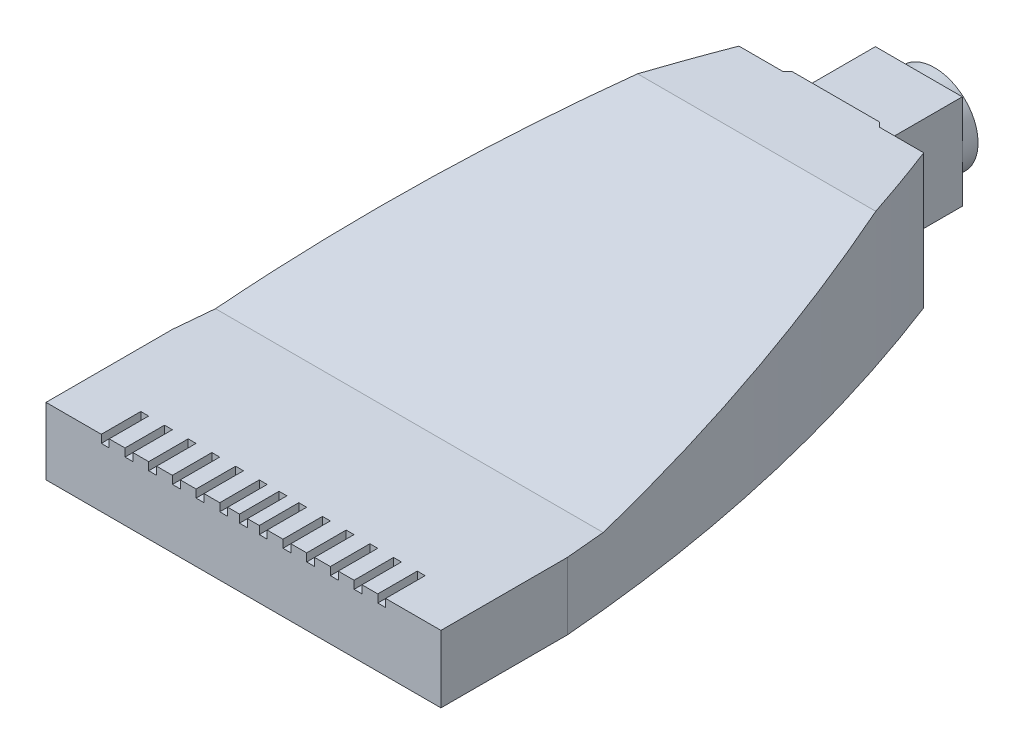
ISO-10303-21;
HEADER;
FILE_DESCRIPTION(('STEP AP214'),'2;1');
FILE_NAME('part.step','',(''),(''),'','','');
FILE_SCHEMA(('AUTOMOTIVE_DESIGN { 1 0 10303 214 1 1 1 1 }'));
ENDSEC;
DATA;
#1=APPLICATION_CONTEXT('core data for automotive mechanical design processes');
#2=APPLICATION_PROTOCOL_DEFINITION('international standard','automotive_design',2000,#1);
#3=PRODUCT_CONTEXT('',#1,'mechanical');
#4=PRODUCT('Part','Part','',(#3));
#5=PRODUCT_RELATED_PRODUCT_CATEGORY('part','',(#4));
#6=PRODUCT_DEFINITION_FORMATION('','',#4);
#7=PRODUCT_DEFINITION_CONTEXT('part definition',#1,'design');
#8=PRODUCT_DEFINITION('design','',#6,#7);
#9=PRODUCT_DEFINITION_SHAPE('','',#8);
#10=(LENGTH_UNIT() NAMED_UNIT(*) SI_UNIT(.MILLI.,.METRE.));
#11=(NAMED_UNIT(*) PLANE_ANGLE_UNIT() SI_UNIT($,.RADIAN.));
#12=(NAMED_UNIT(*) SI_UNIT($,.STERADIAN.) SOLID_ANGLE_UNIT());
#13=UNCERTAINTY_MEASURE_WITH_UNIT(LENGTH_MEASURE(1.E-05),#10,'distance_accuracy_value','');
#14=(GEOMETRIC_REPRESENTATION_CONTEXT(3) GLOBAL_UNCERTAINTY_ASSIGNED_CONTEXT((#13)) GLOBAL_UNIT_ASSIGNED_CONTEXT((#10,
#11,#12)) REPRESENTATION_CONTEXT('',''));
#15=CARTESIAN_POINT('',(0.,0.,0.));
#16=DIRECTION('',(0.,0.,1.));
#17=DIRECTION('',(1.,0.,0.));
#18=AXIS2_PLACEMENT_3D('',#15,#16,#17);
#19=CARTESIAN_POINT('',(0.,17.,23.9406843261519));
#20=DIRECTION('',(0.,0.,-1.));
#21=DIRECTION('',(-1.,0.,0.));
#22=AXIS2_PLACEMENT_3D('',#19,#20,#21);
#23=PLANE('',#22);
#24=DIRECTION('',(0.,1.,0.));
#25=VECTOR('',#24,1.);
#26=CARTESIAN_POINT('',(16.5,7.5,23.9406843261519));
#27=LINE('',#26,#25);
#28=CARTESIAN_POINT('',(16.5,7.5,23.9406843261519));
#29=VERTEX_POINT('',#28);
#30=CARTESIAN_POINT('',(16.5,8.5,23.9406843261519));
#31=VERTEX_POINT('',#30);
#32=EDGE_CURVE('E510',#29,#31,#27,.T.);
#33=ORIENTED_EDGE('',*,*,#32,.T.);
#34=DIRECTION('',(1.,0.,0.));
#35=VECTOR('',#34,1.);
#36=CARTESIAN_POINT('',(-55.5,8.5,23.940684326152));
#37=LINE('',#36,#35);
#38=CARTESIAN_POINT('',(14.5,8.5,23.9406843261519));
#39=VERTEX_POINT('',#38);
#40=EDGE_CURVE('E1121',#39,#31,#37,.T.);
#41=ORIENTED_EDGE('',*,*,#40,.F.);
#42=DIRECTION('',(0.,1.,0.));
#43=VECTOR('',#42,1.);
#44=CARTESIAN_POINT('',(14.5,7.5,23.9406843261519));
#45=LINE('',#44,#43);
#46=CARTESIAN_POINT('',(14.5,7.5,23.9406843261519));
#47=VERTEX_POINT('',#46);
#48=EDGE_CURVE('E61',#47,#39,#45,.T.);
#49=ORIENTED_EDGE('',*,*,#48,.F.);
#50=DIRECTION('',(1.,0.,0.));
#51=VECTOR('',#50,1.);
#52=CARTESIAN_POINT('',(0.,7.5,23.940684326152));
#53=LINE('',#52,#51);
#54=CARTESIAN_POINT('',(13.5,7.5,23.9406843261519));
#55=VERTEX_POINT('',#54);
#56=EDGE_CURVE('E496',#55,#47,#53,.T.);
#57=ORIENTED_EDGE('',*,*,#56,.F.);
#58=DIRECTION('',(0.,1.,0.));
#59=VECTOR('',#58,1.);
#60=CARTESIAN_POINT('',(13.5,7.5,23.9406843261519));
#61=LINE('',#60,#59);
#62=CARTESIAN_POINT('',(13.5,8.5,23.9406843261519));
#63=VERTEX_POINT('',#62);
#64=EDGE_CURVE('E515',#55,#63,#61,.T.);
#65=ORIENTED_EDGE('',*,*,#64,.T.);
#66=CARTESIAN_POINT('',(11.5,8.5,23.940684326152));
#67=VERTEX_POINT('',#66);
#68=EDGE_CURVE('E1117',#67,#63,#37,.T.);
#69=ORIENTED_EDGE('',*,*,#68,.F.);
#70=DIRECTION('',(0.,1.,0.));
#71=VECTOR('',#70,1.);
#72=CARTESIAN_POINT('',(11.5,7.5,23.940684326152));
#73=LINE('',#72,#71);
#74=CARTESIAN_POINT('',(11.5,7.5,23.940684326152));
#75=VERTEX_POINT('',#74);
#76=EDGE_CURVE('E535',#75,#67,#73,.T.);
#77=ORIENTED_EDGE('',*,*,#76,.F.);
#78=DIRECTION('',(1.,0.,0.));
#79=VECTOR('',#78,1.);
#80=CARTESIAN_POINT('',(0.,7.5,23.940684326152));
#81=LINE('',#80,#79);
#82=CARTESIAN_POINT('',(10.5,7.5,23.940684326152));
#83=VERTEX_POINT('',#82);
#84=EDGE_CURVE('E524',#83,#75,#81,.T.);
#85=ORIENTED_EDGE('',*,*,#84,.F.);
#86=DIRECTION('',(0.,1.,0.));
#87=VECTOR('',#86,1.);
#88=CARTESIAN_POINT('',(10.5,7.5,23.940684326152));
#89=LINE('',#88,#87);
#90=CARTESIAN_POINT('',(10.5,8.5,23.940684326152));
#91=VERTEX_POINT('',#90);
#92=EDGE_CURVE('E543',#83,#91,#89,.T.);
#93=ORIENTED_EDGE('',*,*,#92,.T.);
#94=CARTESIAN_POINT('',(8.50000000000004,8.5,23.940684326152));
#95=VERTEX_POINT('',#94);
#96=EDGE_CURVE('E1112',#95,#91,#37,.T.);
#97=ORIENTED_EDGE('',*,*,#96,.F.);
#98=DIRECTION('',(0.,1.,0.));
#99=VECTOR('',#98,1.);
#100=CARTESIAN_POINT('',(8.50000000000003,7.5,23.940684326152));
#101=LINE('',#100,#99);
#102=CARTESIAN_POINT('',(8.50000000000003,7.5,23.940684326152));
#103=VERTEX_POINT('',#102);
#104=EDGE_CURVE('E564',#103,#95,#101,.T.);
#105=ORIENTED_EDGE('',*,*,#104,.F.);
#106=DIRECTION('',(1.,0.,0.));
#107=VECTOR('',#106,1.);
#108=CARTESIAN_POINT('',(0.,7.5,23.940684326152));
#109=LINE('',#108,#107);
#110=CARTESIAN_POINT('',(7.50000000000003,7.5,23.940684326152));
#111=VERTEX_POINT('',#110);
#112=EDGE_CURVE('E552',#111,#103,#109,.T.);
#113=ORIENTED_EDGE('',*,*,#112,.F.);
#114=DIRECTION('',(0.,1.,0.));
#115=VECTOR('',#114,1.);
#116=CARTESIAN_POINT('',(7.50000000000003,7.5,23.940684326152));
#117=LINE('',#116,#115);
#118=CARTESIAN_POINT('',(7.50000000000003,8.5,23.940684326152));
#119=VERTEX_POINT('',#118);
#120=EDGE_CURVE('E571',#111,#119,#117,.T.);
#121=ORIENTED_EDGE('',*,*,#120,.T.);
#122=CARTESIAN_POINT('',(5.50000000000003,8.5,23.940684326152));
#123=VERTEX_POINT('',#122);
#124=EDGE_CURVE('E1107',#123,#119,#37,.T.);
#125=ORIENTED_EDGE('',*,*,#124,.F.);
#126=DIRECTION('',(0.,1.,0.));
#127=VECTOR('',#126,1.);
#128=CARTESIAN_POINT('',(5.50000000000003,7.5,23.940684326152));
#129=LINE('',#128,#127);
#130=CARTESIAN_POINT('',(5.50000000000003,7.5,23.940684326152));
#131=VERTEX_POINT('',#130);
#132=EDGE_CURVE('E592',#131,#123,#129,.T.);
#133=ORIENTED_EDGE('',*,*,#132,.F.);
#134=DIRECTION('',(1.,0.,0.));
#135=VECTOR('',#134,1.);
#136=CARTESIAN_POINT('',(0.,7.5,23.940684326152));
#137=LINE('',#136,#135);
#138=CARTESIAN_POINT('',(4.50000000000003,7.5,23.940684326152));
#139=VERTEX_POINT('',#138);
#140=EDGE_CURVE('E580',#139,#131,#137,.T.);
#141=ORIENTED_EDGE('',*,*,#140,.F.);
#142=DIRECTION('',(0.,1.,0.));
#143=VECTOR('',#142,1.);
#144=CARTESIAN_POINT('',(4.50000000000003,7.5,23.940684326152));
#145=LINE('',#144,#143);
#146=CARTESIAN_POINT('',(4.50000000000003,8.5,23.940684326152));
#147=VERTEX_POINT('',#146);
#148=EDGE_CURVE('E599',#139,#147,#145,.T.);
#149=ORIENTED_EDGE('',*,*,#148,.T.);
#150=CARTESIAN_POINT('',(2.50000000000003,8.5,23.940684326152));
#151=VERTEX_POINT('',#150);
#152=EDGE_CURVE('E1103',#151,#147,#37,.T.);
#153=ORIENTED_EDGE('',*,*,#152,.F.);
#154=DIRECTION('',(0.,1.,0.));
#155=VECTOR('',#154,1.);
#156=CARTESIAN_POINT('',(2.50000000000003,7.5,23.940684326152));
#157=LINE('',#156,#155);
#158=CARTESIAN_POINT('',(2.50000000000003,7.5,23.940684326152));
#159=VERTEX_POINT('',#158);
#160=EDGE_CURVE('E620',#159,#151,#157,.T.);
#161=ORIENTED_EDGE('',*,*,#160,.F.);
#162=DIRECTION('',(1.,0.,0.));
#163=VECTOR('',#162,1.);
#164=CARTESIAN_POINT('',(0.,7.5,23.940684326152));
#165=LINE('',#164,#163);
#166=CARTESIAN_POINT('',(1.50000000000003,7.5,23.940684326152));
#167=VERTEX_POINT('',#166);
#168=EDGE_CURVE('E608',#167,#159,#165,.T.);
#169=ORIENTED_EDGE('',*,*,#168,.F.);
#170=DIRECTION('',(0.,1.,0.));
#171=VECTOR('',#170,1.);
#172=CARTESIAN_POINT('',(1.50000000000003,7.5,23.940684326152));
#173=LINE('',#172,#171);
#174=CARTESIAN_POINT('',(1.50000000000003,8.5,23.940684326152));
#175=VERTEX_POINT('',#174);
#176=EDGE_CURVE('E627',#167,#175,#173,.T.);
#177=ORIENTED_EDGE('',*,*,#176,.T.);
#178=CARTESIAN_POINT('',(0.,8.5,23.940684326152));
#179=VERTEX_POINT('',#178);
#180=EDGE_CURVE('E1100',#179,#175,#37,.T.);
#181=ORIENTED_EDGE('',*,*,#180,.F.);
#182=DIRECTION('',(0.,1.,0.));
#183=VECTOR('',#182,1.);
#184=CARTESIAN_POINT('',(0.,7.5,23.940684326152));
#185=LINE('',#184,#183);
#186=CARTESIAN_POINT('',(0.,7.5,23.940684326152));
#187=VERTEX_POINT('',#186);
#188=EDGE_CURVE('E659',#187,#179,#185,.T.);
#189=ORIENTED_EDGE('',*,*,#188,.F.);
#190=DIRECTION('',(1.,0.,0.));
#191=VECTOR('',#190,1.);
#192=CARTESIAN_POINT('',(0.,7.5,23.940684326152));
#193=LINE('',#192,#191);
#194=CARTESIAN_POINT('',(-0.999999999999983,7.5,23.940684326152));
#195=VERTEX_POINT('',#194);
#196=EDGE_CURVE('E642',#195,#187,#193,.T.);
#197=ORIENTED_EDGE('',*,*,#196,.F.);
#198=DIRECTION('',(0.,1.,0.));
#199=VECTOR('',#198,1.);
#200=CARTESIAN_POINT('',(-0.999999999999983,7.5,23.940684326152));
#201=LINE('',#200,#199);
#202=CARTESIAN_POINT('',(-0.999999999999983,8.5,23.940684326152));
#203=VERTEX_POINT('',#202);
#204=EDGE_CURVE('E661',#195,#203,#201,.T.);
#205=ORIENTED_EDGE('',*,*,#204,.T.);
#206=CARTESIAN_POINT('',(-2.5,8.5,23.940684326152));
#207=VERTEX_POINT('',#206);
#208=EDGE_CURVE('E1097',#207,#203,#37,.T.);
#209=ORIENTED_EDGE('',*,*,#208,.F.);
#210=DIRECTION('',(0.,1.,0.));
#211=VECTOR('',#210,1.);
#212=CARTESIAN_POINT('',(-2.5,7.5,23.940684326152));
#213=LINE('',#212,#211);
#214=CARTESIAN_POINT('',(-2.5,7.5,23.940684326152));
#215=VERTEX_POINT('',#214);
#216=EDGE_CURVE('E684',#215,#207,#213,.T.);
#217=ORIENTED_EDGE('',*,*,#216,.F.);
#218=DIRECTION('',(1.,0.,0.));
#219=VECTOR('',#218,1.);
#220=CARTESIAN_POINT('',(0.,7.5,23.940684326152));
#221=LINE('',#220,#219);
#222=CARTESIAN_POINT('',(-3.5,7.5,23.940684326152));
#223=VERTEX_POINT('',#222);
#224=EDGE_CURVE('E673',#223,#215,#221,.T.);
#225=ORIENTED_EDGE('',*,*,#224,.F.);
#226=DIRECTION('',(0.,1.,0.));
#227=VECTOR('',#226,1.);
#228=CARTESIAN_POINT('',(-3.5,7.5,23.940684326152));
#229=LINE('',#228,#227);
#230=CARTESIAN_POINT('',(-3.5,8.5,23.940684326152));
#231=VERTEX_POINT('',#230);
#232=EDGE_CURVE('E687',#223,#231,#229,.T.);
#233=ORIENTED_EDGE('',*,*,#232,.T.);
#234=CARTESIAN_POINT('',(-5.5,8.5,23.940684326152));
#235=VERTEX_POINT('',#234);
#236=EDGE_CURVE('E1094',#235,#231,#37,.T.);
#237=ORIENTED_EDGE('',*,*,#236,.F.);
#238=DIRECTION('',(0.,1.,0.));
#239=VECTOR('',#238,1.);
#240=CARTESIAN_POINT('',(-5.5,7.5,23.940684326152));
#241=LINE('',#240,#239);
#242=CARTESIAN_POINT('',(-5.5,7.5,23.940684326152));
#243=VERTEX_POINT('',#242);
#244=EDGE_CURVE('E712',#243,#235,#241,.T.);
#245=ORIENTED_EDGE('',*,*,#244,.F.);
#246=DIRECTION('',(1.,0.,0.));
#247=VECTOR('',#246,1.);
#248=CARTESIAN_POINT('',(0.,7.5,23.940684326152));
#249=LINE('',#248,#247);
#250=CARTESIAN_POINT('',(-6.5,7.5,23.940684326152));
#251=VERTEX_POINT('',#250);
#252=EDGE_CURVE('E701',#251,#243,#249,.T.);
#253=ORIENTED_EDGE('',*,*,#252,.F.);
#254=DIRECTION('',(0.,1.,0.));
#255=VECTOR('',#254,1.);
#256=CARTESIAN_POINT('',(-6.5,7.5,23.940684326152));
#257=LINE('',#256,#255);
#258=CARTESIAN_POINT('',(-6.5,8.5,23.940684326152));
#259=VERTEX_POINT('',#258);
#260=EDGE_CURVE('E715',#251,#259,#257,.T.);
#261=ORIENTED_EDGE('',*,*,#260,.T.);
#262=CARTESIAN_POINT('',(-8.5,8.5,23.940684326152));
#263=VERTEX_POINT('',#262);
#264=EDGE_CURVE('E1090',#263,#259,#37,.T.);
#265=ORIENTED_EDGE('',*,*,#264,.F.);
#266=DIRECTION('',(0.,1.,0.));
#267=VECTOR('',#266,1.);
#268=CARTESIAN_POINT('',(-8.5,7.5,23.940684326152));
#269=LINE('',#268,#267);
#270=CARTESIAN_POINT('',(-8.5,7.5,23.940684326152));
#271=VERTEX_POINT('',#270);
#272=EDGE_CURVE('E740',#271,#263,#269,.T.);
#273=ORIENTED_EDGE('',*,*,#272,.F.);
#274=DIRECTION('',(1.,0.,0.));
#275=VECTOR('',#274,1.);
#276=CARTESIAN_POINT('',(0.,7.5,23.940684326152));
#277=LINE('',#276,#275);
#278=CARTESIAN_POINT('',(-9.5,7.5,23.940684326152));
#279=VERTEX_POINT('',#278);
#280=EDGE_CURVE('E729',#279,#271,#277,.T.);
#281=ORIENTED_EDGE('',*,*,#280,.F.);
#282=DIRECTION('',(0.,1.,0.));
#283=VECTOR('',#282,1.);
#284=CARTESIAN_POINT('',(-9.5,7.5,23.940684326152));
#285=LINE('',#284,#283);
#286=CARTESIAN_POINT('',(-9.5,8.5,23.940684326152));
#287=VERTEX_POINT('',#286);
#288=EDGE_CURVE('E743',#279,#287,#285,.T.);
#289=ORIENTED_EDGE('',*,*,#288,.T.);
#290=CARTESIAN_POINT('',(-11.5,8.5,23.940684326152));
#291=VERTEX_POINT('',#290);
#292=EDGE_CURVE('E1086',#291,#287,#37,.T.);
#293=ORIENTED_EDGE('',*,*,#292,.F.);
#294=DIRECTION('',(0.,1.,0.));
#295=VECTOR('',#294,1.);
#296=CARTESIAN_POINT('',(-11.5,7.5,23.940684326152));
#297=LINE('',#296,#295);
#298=CARTESIAN_POINT('',(-11.5,7.5,23.940684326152));
#299=VERTEX_POINT('',#298);
#300=EDGE_CURVE('E761',#299,#291,#297,.T.);
#301=ORIENTED_EDGE('',*,*,#300,.F.);
#302=DIRECTION('',(1.,0.,0.));
#303=VECTOR('',#302,1.);
#304=CARTESIAN_POINT('',(0.,7.5,23.940684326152));
#305=LINE('',#304,#303);
#306=CARTESIAN_POINT('',(-12.5,7.5,23.940684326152));
#307=VERTEX_POINT('',#306);
#308=EDGE_CURVE('E750',#307,#299,#305,.T.);
#309=ORIENTED_EDGE('',*,*,#308,.F.);
#310=DIRECTION('',(0.,1.,0.));
#311=VECTOR('',#310,1.);
#312=CARTESIAN_POINT('',(-12.5,7.5,23.940684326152));
#313=LINE('',#312,#311);
#314=CARTESIAN_POINT('',(-12.5,8.5,23.940684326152));
#315=VERTEX_POINT('',#314);
#316=EDGE_CURVE('E769',#307,#315,#313,.T.);
#317=ORIENTED_EDGE('',*,*,#316,.T.);
#318=CARTESIAN_POINT('',(-14.5,8.5,23.940684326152));
#319=VERTEX_POINT('',#318);
#320=EDGE_CURVE('E1084',#319,#315,#37,.T.);
#321=ORIENTED_EDGE('',*,*,#320,.F.);
#322=DIRECTION('',(0.,1.,0.));
#323=VECTOR('',#322,1.);
#324=CARTESIAN_POINT('',(-14.5,7.5,23.940684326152));
#325=LINE('',#324,#323);
#326=CARTESIAN_POINT('',(-14.5,7.5,23.940684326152));
#327=VERTEX_POINT('',#326);
#328=EDGE_CURVE('E789',#327,#319,#325,.T.);
#329=ORIENTED_EDGE('',*,*,#328,.F.);
#330=DIRECTION('',(1.,0.,0.));
#331=VECTOR('',#330,1.);
#332=CARTESIAN_POINT('',(0.,7.5,23.940684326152));
#333=LINE('',#332,#331);
#334=CARTESIAN_POINT('',(-15.5,7.5,23.940684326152));
#335=VERTEX_POINT('',#334);
#336=EDGE_CURVE('E778',#335,#327,#333,.T.);
#337=ORIENTED_EDGE('',*,*,#336,.F.);
#338=DIRECTION('',(0.,1.,0.));
#339=VECTOR('',#338,1.);
#340=CARTESIAN_POINT('',(-15.5,7.5,23.940684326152));
#341=LINE('',#340,#339);
#342=CARTESIAN_POINT('',(-15.5,8.5,23.940684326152));
#343=VERTEX_POINT('',#342);
#344=EDGE_CURVE('E797',#335,#343,#341,.T.);
#345=ORIENTED_EDGE('',*,*,#344,.T.);
#346=CARTESIAN_POINT('',(-17.5,8.5,23.940684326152));
#347=VERTEX_POINT('',#346);
#348=EDGE_CURVE('E877',#347,#343,#37,.T.);
#349=ORIENTED_EDGE('',*,*,#348,.F.);
#350=DIRECTION('',(0.,1.,0.));
#351=VECTOR('',#350,1.);
#352=CARTESIAN_POINT('',(-17.5,7.5,23.940684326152));
#353=LINE('',#352,#351);
#354=CARTESIAN_POINT('',(-17.5,7.5,23.940684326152));
#355=VERTEX_POINT('',#354);
#356=EDGE_CURVE('E817',#355,#347,#353,.T.);
#357=ORIENTED_EDGE('',*,*,#356,.F.);
#358=DIRECTION('',(1.,0.,0.));
#359=VECTOR('',#358,1.);
#360=CARTESIAN_POINT('',(0.,7.5,23.940684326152));
#361=LINE('',#360,#359);
#362=CARTESIAN_POINT('',(-18.5,7.5,23.940684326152));
#363=VERTEX_POINT('',#362);
#364=EDGE_CURVE('E806',#363,#355,#361,.T.);
#365=ORIENTED_EDGE('',*,*,#364,.F.);
#366=DIRECTION('',(0.,1.,0.));
#367=VECTOR('',#366,1.);
#368=CARTESIAN_POINT('',(-18.5,7.5,23.940684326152));
#369=LINE('',#368,#367);
#370=CARTESIAN_POINT('',(-18.5,8.5,23.940684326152));
#371=VERTEX_POINT('',#370);
#372=EDGE_CURVE('E825',#363,#371,#369,.T.);
#373=ORIENTED_EDGE('',*,*,#372,.T.);
#374=CARTESIAN_POINT('',(-25.5,8.5,23.940684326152));
#375=VERTEX_POINT('',#374);
#376=EDGE_CURVE('E874',#375,#371,#37,.T.);
#377=ORIENTED_EDGE('',*,*,#376,.F.);
#378=DIRECTION('',(0.,-1.,0.));
#379=VECTOR('',#378,1.);
#380=CARTESIAN_POINT('',(-25.5,17.,23.940684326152));
#381=LINE('',#380,#379);
#382=CARTESIAN_POINT('',(-25.5,0.,23.940684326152));
#383=VERTEX_POINT('',#382);
#384=EDGE_CURVE('E998',#375,#383,#381,.T.);
#385=ORIENTED_EDGE('',*,*,#384,.T.);
#386=DIRECTION('',(1.,0.,0.));
#387=VECTOR('',#386,1.);
#388=CARTESIAN_POINT('',(0.,0.,23.9406843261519));
#389=LINE('',#388,#387);
#390=CARTESIAN_POINT('',(24.5,0.,23.9406843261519));
#391=VERTEX_POINT('',#390);
#392=EDGE_CURVE('E978',#383,#391,#389,.T.);
#393=ORIENTED_EDGE('',*,*,#392,.T.);
#394=DIRECTION('',(0.,-1.,0.));
#395=VECTOR('',#394,1.);
#396=CARTESIAN_POINT('',(24.5,17.,23.9406843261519));
#397=LINE('',#396,#395);
#398=CARTESIAN_POINT('',(24.5,8.5,23.9406843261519));
#399=VERTEX_POINT('',#398);
#400=EDGE_CURVE('E996',#399,#391,#397,.T.);
#401=ORIENTED_EDGE('',*,*,#400,.F.);
#402=CARTESIAN_POINT('',(17.5,8.5,23.9406843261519));
#403=VERTEX_POINT('',#402);
#404=EDGE_CURVE('E489',#403,#399,#37,.T.);
#405=ORIENTED_EDGE('',*,*,#404,.F.);
#406=DIRECTION('',(0.,1.,0.));
#407=VECTOR('',#406,1.);
#408=CARTESIAN_POINT('',(17.5,7.5,23.9406843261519));
#409=LINE('',#408,#407);
#410=CARTESIAN_POINT('',(17.5,7.5,23.9406843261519));
#411=VERTEX_POINT('',#410);
#412=EDGE_CURVE('E53',#411,#403,#409,.T.);
#413=ORIENTED_EDGE('',*,*,#412,.F.);
#414=DIRECTION('',(1.,0.,0.));
#415=VECTOR('',#414,1.);
#416=CARTESIAN_POINT('',(0.,7.5,23.940684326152));
#417=LINE('',#416,#415);
#418=EDGE_CURVE('E477',#29,#411,#417,.T.);
#419=ORIENTED_EDGE('',*,*,#418,.F.);
#420=EDGE_LOOP('',(#33,#41,#49,#57,#65,#69,#77,#85,#93,#97,#105,#113,#121,#125,#133,#141,#149,
#153,#161,#169,#177,#181,#189,#197,#205,#209,#217,#225,#233,#237,#245,#253,#261,#265,#273,#281,
#289,#293,#301,#309,#317,#321,#329,#337,#345,#349,#357,#365,#373,#377,#385,#393,#401,#405,#413,#419));
#421=FACE_BOUND('',#420,.T.);
#422=ADVANCED_FACE('F34',(#421),#23,.F.);
#423=CARTESIAN_POINT('',(-55.5,8.5,0.));
#424=DIRECTION('',(0.,-1.,0.));
#425=DIRECTION('',(0.,0.,-1.));
#426=AXIS2_PLACEMENT_3D('',#423,#424,#425);
#427=PLANE('',#426);
#428=DIRECTION('',(0.,0.,-1.));
#429=VECTOR('',#428,1.);
#430=CARTESIAN_POINT('',(16.5,8.5,0.));
#431=LINE('',#430,#429);
#432=CARTESIAN_POINT('',(16.5,8.5,18.940684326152));
#433=VERTEX_POINT('',#432);
#434=EDGE_CURVE('E485',#31,#433,#431,.T.);
#435=ORIENTED_EDGE('',*,*,#434,.T.);
#436=DIRECTION('',(1.,0.,0.));
#437=VECTOR('',#436,1.);
#438=CARTESIAN_POINT('',(0.,8.5,18.940684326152));
#439=LINE('',#438,#437);
#440=CARTESIAN_POINT('',(17.5,8.5,18.940684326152));
#441=VERTEX_POINT('',#440);
#442=EDGE_CURVE('E1129',#433,#441,#439,.T.);
#443=ORIENTED_EDGE('',*,*,#442,.T.);
#444=DIRECTION('',(0.,0.,-1.));
#445=VECTOR('',#444,1.);
#446=CARTESIAN_POINT('',(17.5,8.5,0.));
#447=LINE('',#446,#445);
#448=EDGE_CURVE('E1127',#403,#441,#447,.T.);
#449=ORIENTED_EDGE('',*,*,#448,.F.);
#450=ORIENTED_EDGE('',*,*,#404,.T.);
#451=DIRECTION('',(0.,0.,-1.));
#452=VECTOR('',#451,1.);
#453=CARTESIAN_POINT('',(24.5,8.5,0.));
#454=LINE('',#453,#452);
#455=CARTESIAN_POINT('',(24.5,8.5,7.94068432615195));
#456=VERTEX_POINT('',#455);
#457=EDGE_CURVE('E865',#399,#456,#454,.T.);
#458=ORIENTED_EDGE('',*,*,#457,.T.);
#459=CARTESIAN_POINT('',(24.5,8.5,7.94068432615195));
#460=CARTESIAN_POINT('',(22.0650337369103,8.5,-22.2267649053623));
#461=CARTESIAN_POINT('',(11.1947023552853,8.5,-50.4823249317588));
#462=B_SPLINE_CURVE_WITH_KNOTS('',2,(#459,#460,#461),.UNSPECIFIED.,.F.,.F.,(3,3),(0.,1.),.UNSPECIFIED.);
#463=CARTESIAN_POINT('',(24.0372044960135,8.5,2.94146595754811));
#464=VERTEX_POINT('',#463);
#465=EDGE_CURVE('E38',#464,#456,#462,.F.);
#466=ORIENTED_EDGE('',*,*,#465,.F.);
#467=DIRECTION('',(1.,0.,0.));
#468=VECTOR('',#467,1.);
#469=CARTESIAN_POINT('',(-55.5,8.5,2.94146595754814));
#470=LINE('',#469,#468);
#471=CARTESIAN_POINT('',(-25.0372044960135,8.5,2.94146595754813));
#472=VERTEX_POINT('',#471);
#473=EDGE_CURVE('E870',#472,#464,#470,.T.);
#474=ORIENTED_EDGE('',*,*,#473,.F.);
#475=CARTESIAN_POINT('',(-25.5,8.5,7.94068432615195));
#476=CARTESIAN_POINT('',(-23.0650337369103,8.5,-22.2267649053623));
#477=CARTESIAN_POINT('',(-12.1947023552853,8.5,-50.4823249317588));
#478=B_SPLINE_CURVE_WITH_KNOTS('',2,(#475,#476,#477),.UNSPECIFIED.,.F.,.F.,(3,3),(0.,1.),.UNSPECIFIED.);
#479=CARTESIAN_POINT('',(-25.5,8.5,7.94068432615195));
#480=VERTEX_POINT('',#479);
#481=EDGE_CURVE('E958',#472,#480,#478,.F.);
#482=ORIENTED_EDGE('',*,*,#481,.T.);
#483=DIRECTION('',(0.,0.,1.));
#484=VECTOR('',#483,1.);
#485=CARTESIAN_POINT('',(-25.5,8.5,0.));
#486=LINE('',#485,#484);
#487=EDGE_CURVE('E1061',#480,#375,#486,.T.);
#488=ORIENTED_EDGE('',*,*,#487,.T.);
#489=ORIENTED_EDGE('',*,*,#376,.T.);
#490=DIRECTION('',(0.,0.,-1.));
#491=VECTOR('',#490,1.);
#492=CARTESIAN_POINT('',(-18.5,8.5,0.));
#493=LINE('',#492,#491);
#494=CARTESIAN_POINT('',(-18.5,8.5,18.940684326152));
#495=VERTEX_POINT('',#494);
#496=EDGE_CURVE('E810',#371,#495,#493,.T.);
#497=ORIENTED_EDGE('',*,*,#496,.T.);
#498=DIRECTION('',(1.,0.,0.));
#499=VECTOR('',#498,1.);
#500=CARTESIAN_POINT('',(0.,8.5,18.940684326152));
#501=LINE('',#500,#499);
#502=CARTESIAN_POINT('',(-17.5,8.5,18.940684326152));
#503=VERTEX_POINT('',#502);
#504=EDGE_CURVE('E820',#495,#503,#501,.T.);
#505=ORIENTED_EDGE('',*,*,#504,.T.);
#506=DIRECTION('',(0.,0.,-1.));
#507=VECTOR('',#506,1.);
#508=CARTESIAN_POINT('',(-17.5,8.5,0.));
#509=LINE('',#508,#507);
#510=EDGE_CURVE('E800',#347,#503,#509,.T.);
#511=ORIENTED_EDGE('',*,*,#510,.F.);
#512=ORIENTED_EDGE('',*,*,#348,.T.);
#513=DIRECTION('',(0.,0.,-1.));
#514=VECTOR('',#513,1.);
#515=CARTESIAN_POINT('',(-15.5,8.5,0.));
#516=LINE('',#515,#514);
#517=CARTESIAN_POINT('',(-15.5,8.5,18.940684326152));
#518=VERTEX_POINT('',#517);
#519=EDGE_CURVE('E782',#343,#518,#516,.T.);
#520=ORIENTED_EDGE('',*,*,#519,.T.);
#521=DIRECTION('',(1.,0.,0.));
#522=VECTOR('',#521,1.);
#523=CARTESIAN_POINT('',(0.,8.5,18.940684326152));
#524=LINE('',#523,#522);
#525=CARTESIAN_POINT('',(-14.5,8.5,18.940684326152));
#526=VERTEX_POINT('',#525);
#527=EDGE_CURVE('E792',#518,#526,#524,.T.);
#528=ORIENTED_EDGE('',*,*,#527,.T.);
#529=DIRECTION('',(0.,0.,-1.));
#530=VECTOR('',#529,1.);
#531=CARTESIAN_POINT('',(-14.5,8.5,0.));
#532=LINE('',#531,#530);
#533=EDGE_CURVE('E772',#319,#526,#532,.T.);
#534=ORIENTED_EDGE('',*,*,#533,.F.);
#535=ORIENTED_EDGE('',*,*,#320,.T.);
#536=DIRECTION('',(0.,0.,-1.));
#537=VECTOR('',#536,1.);
#538=CARTESIAN_POINT('',(-12.5,8.5,0.));
#539=LINE('',#538,#537);
#540=CARTESIAN_POINT('',(-12.5,8.5,18.940684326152));
#541=VERTEX_POINT('',#540);
#542=EDGE_CURVE('E754',#315,#541,#539,.T.);
#543=ORIENTED_EDGE('',*,*,#542,.T.);
#544=DIRECTION('',(1.,0.,0.));
#545=VECTOR('',#544,1.);
#546=CARTESIAN_POINT('',(0.,8.5,18.940684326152));
#547=LINE('',#546,#545);
#548=CARTESIAN_POINT('',(-11.5,8.5,18.940684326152));
#549=VERTEX_POINT('',#548);
#550=EDGE_CURVE('E764',#541,#549,#547,.T.);
#551=ORIENTED_EDGE('',*,*,#550,.T.);
#552=DIRECTION('',(0.,0.,-1.));
#553=VECTOR('',#552,1.);
#554=CARTESIAN_POINT('',(-11.5,8.5,0.));
#555=LINE('',#554,#553);
#556=EDGE_CURVE('E742',#291,#549,#555,.T.);
#557=ORIENTED_EDGE('',*,*,#556,.F.);
#558=ORIENTED_EDGE('',*,*,#292,.T.);
#559=DIRECTION('',(0.,0.,-1.));
#560=VECTOR('',#559,1.);
#561=CARTESIAN_POINT('',(-9.5,8.5,0.));
#562=LINE('',#561,#560);
#563=CARTESIAN_POINT('',(-9.5,8.5,18.940684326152));
#564=VERTEX_POINT('',#563);
#565=EDGE_CURVE('E725',#287,#564,#562,.T.);
#566=ORIENTED_EDGE('',*,*,#565,.T.);
#567=DIRECTION('',(1.,0.,0.));
#568=VECTOR('',#567,1.);
#569=CARTESIAN_POINT('',(0.,8.5,18.940684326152));
#570=LINE('',#569,#568);
#571=CARTESIAN_POINT('',(-8.5,8.5,18.940684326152));
#572=VERTEX_POINT('',#571);
#573=EDGE_CURVE('E735',#564,#572,#570,.T.);
#574=ORIENTED_EDGE('',*,*,#573,.T.);
#575=DIRECTION('',(0.,0.,1.));
#576=VECTOR('',#575,1.);
#577=CARTESIAN_POINT('',(-8.5,8.5,0.));
#578=LINE('',#577,#576);
#579=EDGE_CURVE('E714',#572,#263,#578,.T.);
#580=ORIENTED_EDGE('',*,*,#579,.T.);
#581=ORIENTED_EDGE('',*,*,#264,.T.);
#582=DIRECTION('',(0.,0.,-1.));
#583=VECTOR('',#582,1.);
#584=CARTESIAN_POINT('',(-6.5,8.5,0.));
#585=LINE('',#584,#583);
#586=CARTESIAN_POINT('',(-6.5,8.5,18.940684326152));
#587=VERTEX_POINT('',#586);
#588=EDGE_CURVE('E697',#259,#587,#585,.T.);
#589=ORIENTED_EDGE('',*,*,#588,.T.);
#590=DIRECTION('',(1.,0.,0.));
#591=VECTOR('',#590,1.);
#592=CARTESIAN_POINT('',(0.,8.5,18.940684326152));
#593=LINE('',#592,#591);
#594=CARTESIAN_POINT('',(-5.5,8.5,18.940684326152));
#595=VERTEX_POINT('',#594);
#596=EDGE_CURVE('E707',#587,#595,#593,.T.);
#597=ORIENTED_EDGE('',*,*,#596,.T.);
#598=DIRECTION('',(0.,0.,1.));
#599=VECTOR('',#598,1.);
#600=CARTESIAN_POINT('',(-5.5,8.5,0.));
#601=LINE('',#600,#599);
#602=EDGE_CURVE('E686',#595,#235,#601,.T.);
#603=ORIENTED_EDGE('',*,*,#602,.T.);
#604=ORIENTED_EDGE('',*,*,#236,.T.);
#605=DIRECTION('',(0.,0.,-1.));
#606=VECTOR('',#605,1.);
#607=CARTESIAN_POINT('',(-3.5,8.5,0.));
#608=LINE('',#607,#606);
#609=CARTESIAN_POINT('',(-3.5,8.5,18.940684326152));
#610=VERTEX_POINT('',#609);
#611=EDGE_CURVE('E669',#231,#610,#608,.T.);
#612=ORIENTED_EDGE('',*,*,#611,.T.);
#613=DIRECTION('',(1.,0.,0.));
#614=VECTOR('',#613,1.);
#615=CARTESIAN_POINT('',(0.,8.5,18.940684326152));
#616=LINE('',#615,#614);
#617=CARTESIAN_POINT('',(-2.5,8.5,18.940684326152));
#618=VERTEX_POINT('',#617);
#619=EDGE_CURVE('E679',#610,#618,#616,.T.);
#620=ORIENTED_EDGE('',*,*,#619,.T.);
#621=DIRECTION('',(0.,0.,1.));
#622=VECTOR('',#621,1.);
#623=CARTESIAN_POINT('',(-2.5,8.5,0.));
#624=LINE('',#623,#622);
#625=EDGE_CURVE('E658',#618,#207,#624,.T.);
#626=ORIENTED_EDGE('',*,*,#625,.T.);
#627=ORIENTED_EDGE('',*,*,#208,.T.);
#628=DIRECTION('',(0.,0.,-1.));
#629=VECTOR('',#628,1.);
#630=CARTESIAN_POINT('',(-0.999999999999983,8.5,0.));
#631=LINE('',#630,#629);
#632=CARTESIAN_POINT('',(-0.99999999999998,8.5,18.940684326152));
#633=VERTEX_POINT('',#632);
#634=EDGE_CURVE('E650',#203,#633,#631,.T.);
#635=ORIENTED_EDGE('',*,*,#634,.T.);
#636=DIRECTION('',(1.,0.,0.));
#637=VECTOR('',#636,1.);
#638=CARTESIAN_POINT('',(0.,8.5,18.940684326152));
#639=LINE('',#638,#637);
#640=CARTESIAN_POINT('',(0.,8.5,18.940684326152));
#641=VERTEX_POINT('',#640);
#642=EDGE_CURVE('E630',#633,#641,#639,.T.);
#643=ORIENTED_EDGE('',*,*,#642,.T.);
#644=DIRECTION('',(0.,0.,1.));
#645=VECTOR('',#644,1.);
#646=CARTESIAN_POINT('',(0.,8.5,0.));
#647=LINE('',#646,#645);
#648=EDGE_CURVE('E640',#641,#179,#647,.T.);
#649=ORIENTED_EDGE('',*,*,#648,.T.);
#650=ORIENTED_EDGE('',*,*,#180,.T.);
#651=DIRECTION('',(0.,0.,1.));
#652=VECTOR('',#651,1.);
#653=CARTESIAN_POINT('',(1.50000000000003,8.5,0.));
#654=LINE('',#653,#652);
#655=CARTESIAN_POINT('',(1.50000000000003,8.5,18.940684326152));
#656=VERTEX_POINT('',#655);
#657=EDGE_CURVE('E612',#656,#175,#654,.T.);
#658=ORIENTED_EDGE('',*,*,#657,.F.);
#659=DIRECTION('',(1.,0.,0.));
#660=VECTOR('',#659,1.);
#661=CARTESIAN_POINT('',(0.,8.5,18.940684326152));
#662=LINE('',#661,#660);
#663=CARTESIAN_POINT('',(2.50000000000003,8.5,18.940684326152));
#664=VERTEX_POINT('',#663);
#665=EDGE_CURVE('E623',#656,#664,#662,.T.);
#666=ORIENTED_EDGE('',*,*,#665,.T.);
#667=DIRECTION('',(0.,0.,-1.));
#668=VECTOR('',#667,1.);
#669=CARTESIAN_POINT('',(2.50000000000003,8.5,0.));
#670=LINE('',#669,#668);
#671=EDGE_CURVE('E602',#151,#664,#670,.T.);
#672=ORIENTED_EDGE('',*,*,#671,.F.);
#673=ORIENTED_EDGE('',*,*,#152,.T.);
#674=DIRECTION('',(0.,0.,1.));
#675=VECTOR('',#674,1.);
#676=CARTESIAN_POINT('',(4.50000000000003,8.5,0.));
#677=LINE('',#676,#675);
#678=CARTESIAN_POINT('',(4.50000000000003,8.5,18.940684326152));
#679=VERTEX_POINT('',#678);
#680=EDGE_CURVE('E584',#679,#147,#677,.T.);
#681=ORIENTED_EDGE('',*,*,#680,.F.);
#682=DIRECTION('',(1.,0.,0.));
#683=VECTOR('',#682,1.);
#684=CARTESIAN_POINT('',(0.,8.5,18.940684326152));
#685=LINE('',#684,#683);
#686=CARTESIAN_POINT('',(5.50000000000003,8.5,18.940684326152));
#687=VERTEX_POINT('',#686);
#688=EDGE_CURVE('E595',#679,#687,#685,.T.);
#689=ORIENTED_EDGE('',*,*,#688,.T.);
#690=DIRECTION('',(0.,0.,-1.));
#691=VECTOR('',#690,1.);
#692=CARTESIAN_POINT('',(5.50000000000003,8.5,0.));
#693=LINE('',#692,#691);
#694=EDGE_CURVE('E574',#123,#687,#693,.T.);
#695=ORIENTED_EDGE('',*,*,#694,.F.);
#696=ORIENTED_EDGE('',*,*,#124,.T.);
#697=DIRECTION('',(0.,0.,1.));
#698=VECTOR('',#697,1.);
#699=CARTESIAN_POINT('',(7.50000000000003,8.5,0.));
#700=LINE('',#699,#698);
#701=CARTESIAN_POINT('',(7.50000000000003,8.5,18.940684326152));
#702=VERTEX_POINT('',#701);
#703=EDGE_CURVE('E556',#702,#119,#700,.T.);
#704=ORIENTED_EDGE('',*,*,#703,.F.);
#705=DIRECTION('',(1.,0.,0.));
#706=VECTOR('',#705,1.);
#707=CARTESIAN_POINT('',(0.,8.5,18.940684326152));
#708=LINE('',#707,#706);
#709=CARTESIAN_POINT('',(8.50000000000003,8.5,18.940684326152));
#710=VERTEX_POINT('',#709);
#711=EDGE_CURVE('E567',#702,#710,#708,.T.);
#712=ORIENTED_EDGE('',*,*,#711,.T.);
#713=DIRECTION('',(0.,0.,-1.));
#714=VECTOR('',#713,1.);
#715=CARTESIAN_POINT('',(8.50000000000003,8.5,0.));
#716=LINE('',#715,#714);
#717=EDGE_CURVE('E546',#95,#710,#716,.T.);
#718=ORIENTED_EDGE('',*,*,#717,.F.);
#719=ORIENTED_EDGE('',*,*,#96,.T.);
#720=DIRECTION('',(0.,0.,-1.));
#721=VECTOR('',#720,1.);
#722=CARTESIAN_POINT('',(10.5,8.5,0.));
#723=LINE('',#722,#721);
#724=CARTESIAN_POINT('',(10.5,8.5,18.940684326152));
#725=VERTEX_POINT('',#724);
#726=EDGE_CURVE('E528',#91,#725,#723,.T.);
#727=ORIENTED_EDGE('',*,*,#726,.T.);
#728=DIRECTION('',(1.,0.,0.));
#729=VECTOR('',#728,1.);
#730=CARTESIAN_POINT('',(0.,8.5,18.940684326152));
#731=LINE('',#730,#729);
#732=CARTESIAN_POINT('',(11.5,8.5,18.940684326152));
#733=VERTEX_POINT('',#732);
#734=EDGE_CURVE('E538',#725,#733,#731,.T.);
#735=ORIENTED_EDGE('',*,*,#734,.T.);
#736=DIRECTION('',(0.,0.,-1.));
#737=VECTOR('',#736,1.);
#738=CARTESIAN_POINT('',(11.5,8.5,0.));
#739=LINE('',#738,#737);
#740=EDGE_CURVE('E518',#67,#733,#739,.T.);
#741=ORIENTED_EDGE('',*,*,#740,.F.);
#742=ORIENTED_EDGE('',*,*,#68,.T.);
#743=DIRECTION('',(0.,0.,-1.));
#744=VECTOR('',#743,1.);
#745=CARTESIAN_POINT('',(13.5,8.5,0.));
#746=LINE('',#745,#744);
#747=CARTESIAN_POINT('',(13.5,8.5,18.940684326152));
#748=VERTEX_POINT('',#747);
#749=EDGE_CURVE('E500',#63,#748,#746,.T.);
#750=ORIENTED_EDGE('',*,*,#749,.T.);
#751=DIRECTION('',(1.,0.,0.));
#752=VECTOR('',#751,1.);
#753=CARTESIAN_POINT('',(0.,8.5,18.940684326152));
#754=LINE('',#753,#752);
#755=CARTESIAN_POINT('',(14.5,8.5,18.940684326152));
#756=VERTEX_POINT('',#755);
#757=EDGE_CURVE('E509',#748,#756,#754,.T.);
#758=ORIENTED_EDGE('',*,*,#757,.T.);
#759=DIRECTION('',(0.,0.,-1.));
#760=VECTOR('',#759,1.);
#761=CARTESIAN_POINT('',(14.5,8.5,0.));
#762=LINE('',#761,#760);
#763=EDGE_CURVE('E507',#39,#756,#762,.T.);
#764=ORIENTED_EDGE('',*,*,#763,.F.);
#765=ORIENTED_EDGE('',*,*,#40,.T.);
#766=EDGE_LOOP('',(#435,#443,#449,#450,#458,#466,#474,#482,#488,#489,#497,#505,#511,#512,#520,
#528,#534,#535,#543,#551,#557,#558,#566,#574,#580,#581,#589,#597,#603,#604,#612,#620,#626,#627,
#635,#643,#649,#650,#658,#666,#672,#673,#681,#689,#695,#696,#704,#712,#718,#719,#727,#735,#741,
#742,#750,#758,#764,#765));
#767=FACE_BOUND('',#766,.T.);
#768=ADVANCED_FACE('F904',(#767),#427,.F.);
#769=CARTESIAN_POINT('',(0.,17.,-61.559315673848));
#770=DIRECTION('',(0.,0.,-1.));
#771=DIRECTION('',(-1.,0.,0.));
#772=AXIS2_PLACEMENT_3D('',#769,#770,#771);
#773=PLANE('',#772);
#774=CARTESIAN_POINT('',(-0.499999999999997,8.443251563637,-61.559315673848));
#775=DIRECTION('',(0.,0.,-1.));
#776=DIRECTION('',(-1.,0.,0.));
#777=AXIS2_PLACEMENT_3D('',#774,#775,#776);
#778=CIRCLE('',#777,5.5);
#779=CARTESIAN_POINT('',(-6.,8.443251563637,-61.559315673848));
#780=VERTEX_POINT('',#779);
#781=CARTESIAN_POINT('',(5.,8.443251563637,-61.559315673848));
#782=VERTEX_POINT('',#781);
#783=EDGE_CURVE('E46',#780,#782,#778,.T.);
#784=ORIENTED_EDGE('',*,*,#783,.F.);
#785=DIRECTION('',(0.,-1.,0.));
#786=VECTOR('',#785,1.);
#787=CARTESIAN_POINT('',(-5.99999999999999,17.,-61.559315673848));
#788=LINE('',#787,#786);
#789=CARTESIAN_POINT('',(-5.99999999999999,14.5,-61.559315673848));
#790=VERTEX_POINT('',#789);
#791=EDGE_CURVE('E1011',#790,#780,#788,.T.);
#792=ORIENTED_EDGE('',*,*,#791,.F.);
#793=DIRECTION('',(1.,0.,0.));
#794=VECTOR('',#793,1.);
#795=CARTESIAN_POINT('',(-5.99999999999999,14.5,-61.559315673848));
#796=LINE('',#795,#794);
#797=CARTESIAN_POINT('',(5.,14.5,-61.559315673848));
#798=VERTEX_POINT('',#797);
#799=EDGE_CURVE('E862',#790,#798,#796,.T.);
#800=ORIENTED_EDGE('',*,*,#799,.T.);
#801=DIRECTION('',(0.,-1.,0.));
#802=VECTOR('',#801,1.);
#803=CARTESIAN_POINT('',(5.,17.,-61.559315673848));
#804=LINE('',#803,#802);
#805=EDGE_CURVE('E1014',#798,#782,#804,.T.);
#806=ORIENTED_EDGE('',*,*,#805,.T.);
#807=EDGE_LOOP('',(#784,#792,#800,#806));
#808=FACE_BOUND('',#807,.T.);
#809=ADVANCED_FACE('F920',(#808),#773,.T.);
#810=CARTESIAN_POINT('',(0.,17.,-50.4823249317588));
#811=DIRECTION('',(0.,0.,-1.));
#812=DIRECTION('',(-1.,0.,0.));
#813=AXIS2_PLACEMENT_3D('',#810,#811,#812);
#814=PLANE('',#813);
#815=DIRECTION('',(1.,0.,0.));
#816=VECTOR('',#815,1.);
#817=CARTESIAN_POINT('',(0.,0.,-50.4823249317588));
#818=LINE('',#817,#816);
#819=CARTESIAN_POINT('',(5.57699074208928,0.,-50.4823249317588));
#820=VERTEX_POINT('',#819);
#821=CARTESIAN_POINT('',(11.1947023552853,0.,-50.4823249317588));
#822=VERTEX_POINT('',#821);
#823=EDGE_CURVE('E951',#820,#822,#818,.T.);
#824=ORIENTED_EDGE('',*,*,#823,.F.);
#825=DIRECTION('',(0.,-1.,0.));
#826=VECTOR('',#825,1.);
#827=CARTESIAN_POINT('',(5.57699074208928,17.,-50.4823249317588));
#828=LINE('',#827,#826);
#829=CARTESIAN_POINT('',(5.57699074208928,17.,-50.4823249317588));
#830=VERTEX_POINT('',#829);
#831=EDGE_CURVE('E1021',#830,#820,#828,.T.);
#832=ORIENTED_EDGE('',*,*,#831,.F.);
#833=DIRECTION('',(1.,0.,0.));
#834=VECTOR('',#833,1.);
#835=CARTESIAN_POINT('',(0.,17.,-50.4823249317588));
#836=LINE('',#835,#834);
#837=CARTESIAN_POINT('',(11.1947023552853,17.,-50.4823249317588));
#838=VERTEX_POINT('',#837);
#839=EDGE_CURVE('E989',#830,#838,#836,.T.);
#840=ORIENTED_EDGE('',*,*,#839,.T.);
#841=DIRECTION('',(0.,-1.,0.));
#842=VECTOR('',#841,1.);
#843=CARTESIAN_POINT('',(11.1947023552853,17.,-50.4823249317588));
#844=LINE('',#843,#842);
#845=EDGE_CURVE('E950',#838,#822,#844,.T.);
#846=ORIENTED_EDGE('',*,*,#845,.T.);
#847=EDGE_LOOP('',(#824,#832,#840,#846));
#848=FACE_BOUND('',#847,.T.);
#849=ADVANCED_FACE('F36',(#848),#814,.T.);
#850=CARTESIAN_POINT('',(28.029657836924,17.,-28.0296578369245));
#851=DIRECTION('',(0.707106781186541,0.,-0.707106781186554));
#852=DIRECTION('',(-0.707106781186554,0.,-0.707106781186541));
#853=AXIS2_PLACEMENT_3D('',#850,#851,#852);
#854=PLANE('',#853);
#855=DIRECTION('',(0.707106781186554,0.,0.707106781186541));
#856=VECTOR('',#855,1.);
#857=CARTESIAN_POINT('',(28.029657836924,0.,-28.0296578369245));
#858=LINE('',#857,#856);
#859=CARTESIAN_POINT('',(5.,0.,-51.059315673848));
#860=VERTEX_POINT('',#859);
#861=EDGE_CURVE('E957',#860,#820,#858,.T.);
#862=ORIENTED_EDGE('',*,*,#861,.F.);
#863=DIRECTION('',(0.,-1.,0.));
#864=VECTOR('',#863,1.);
#865=CARTESIAN_POINT('',(5.,0.,-51.059315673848));
#866=LINE('',#865,#864);
#867=CARTESIAN_POINT('',(5.,2.5,-51.059315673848));
#868=VERTEX_POINT('',#867);
#869=EDGE_CURVE('E842',#868,#860,#866,.T.);
#870=ORIENTED_EDGE('',*,*,#869,.F.);
#871=DIRECTION('',(0.,-1.,0.));
#872=VECTOR('',#871,1.);
#873=CARTESIAN_POINT('',(5.,17.,-51.059315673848));
#874=LINE('',#873,#872);
#875=CARTESIAN_POINT('',(5.,14.5,-51.059315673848));
#876=VERTEX_POINT('',#875);
#877=EDGE_CURVE('E1017',#876,#868,#874,.T.);
#878=ORIENTED_EDGE('',*,*,#877,.F.);
#879=CARTESIAN_POINT('',(5.,17.,-51.059315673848));
#880=VERTEX_POINT('',#879);
#881=EDGE_CURVE('E1018',#880,#876,#874,.T.);
#882=ORIENTED_EDGE('',*,*,#881,.F.);
#883=DIRECTION('',(0.707106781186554,0.,0.707106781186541));
#884=VECTOR('',#883,1.);
#885=CARTESIAN_POINT('',(28.029657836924,17.,-28.0296578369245));
#886=LINE('',#885,#884);
#887=EDGE_CURVE('E1042',#880,#830,#886,.T.);
#888=ORIENTED_EDGE('',*,*,#887,.T.);
#889=ORIENTED_EDGE('',*,*,#831,.T.);
#890=EDGE_LOOP('',(#862,#870,#878,#882,#888,#889));
#891=FACE_BOUND('',#890,.T.);
#892=ADVANCED_FACE('F1371',(#891),#854,.T.);
#893=CARTESIAN_POINT('',(5.00000000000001,17.,0.));
#894=DIRECTION('',(1.,0.,0.));
#895=DIRECTION('',(0.,0.,-1.));
#896=AXIS2_PLACEMENT_3D('',#893,#894,#895);
#897=PLANE('',#896);
#898=DIRECTION('',(0.,0.,1.));
#899=VECTOR('',#898,1.);
#900=CARTESIAN_POINT('',(5.,2.5,-61.559315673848));
#901=LINE('',#900,#899);
#902=CARTESIAN_POINT('',(5.,2.5,-61.559315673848));
#903=VERTEX_POINT('',#902);
#904=EDGE_CURVE('E835',#903,#868,#901,.T.);
#905=ORIENTED_EDGE('',*,*,#904,.F.);
#906=EDGE_CURVE('E1013',#782,#903,#804,.T.);
#907=ORIENTED_EDGE('',*,*,#906,.F.);
#908=ORIENTED_EDGE('',*,*,#805,.F.);
#909=DIRECTION('',(0.,0.,-1.));
#910=VECTOR('',#909,1.);
#911=CARTESIAN_POINT('',(5.,14.5,-61.559315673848));
#912=LINE('',#911,#910);
#913=EDGE_CURVE('E852',#876,#798,#912,.T.);
#914=ORIENTED_EDGE('',*,*,#913,.F.);
#915=ORIENTED_EDGE('',*,*,#877,.T.);
#916=EDGE_LOOP('',(#905,#907,#908,#914,#915));
#917=FACE_BOUND('',#916,.T.);
#918=ADVANCED_FACE('F1367',(#917),#897,.T.);
#919=EDGE_CURVE('E11',#782,#780,#778,.T.);
#920=ORIENTED_EDGE('',*,*,#919,.F.);
#921=ORIENTED_EDGE('',*,*,#906,.T.);
#922=DIRECTION('',(1.,0.,0.));
#923=VECTOR('',#922,1.);
#924=CARTESIAN_POINT('',(-5.99999999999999,2.5,-61.559315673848));
#925=LINE('',#924,#923);
#926=CARTESIAN_POINT('',(-5.99999999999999,2.5,-61.559315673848));
#927=VERTEX_POINT('',#926);
#928=EDGE_CURVE('E845',#927,#903,#925,.T.);
#929=ORIENTED_EDGE('',*,*,#928,.F.);
#930=EDGE_CURVE('E1010',#780,#927,#788,.T.);
#931=ORIENTED_EDGE('',*,*,#930,.F.);
#932=EDGE_LOOP('',(#920,#921,#929,#931));
#933=FACE_BOUND('',#932,.T.);
#934=ADVANCED_FACE('F1383',(#933),#773,.T.);
#935=CARTESIAN_POINT('',(-5.99999999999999,17.,0.));
#936=DIRECTION('',(-1.,0.,0.));
#937=DIRECTION('',(0.,0.,1.));
#938=AXIS2_PLACEMENT_3D('',#935,#936,#937);
#939=PLANE('',#938);
#940=DIRECTION('',(0.,0.,1.));
#941=VECTOR('',#940,1.);
#942=CARTESIAN_POINT('',(-5.99999999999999,2.5,-61.559315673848));
#943=LINE('',#942,#941);
#944=CARTESIAN_POINT('',(-5.99999999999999,2.5,-51.059315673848));
#945=VERTEX_POINT('',#944);
#946=EDGE_CURVE('E838',#927,#945,#943,.T.);
#947=ORIENTED_EDGE('',*,*,#946,.T.);
#948=DIRECTION('',(0.,-1.,0.));
#949=VECTOR('',#948,1.);
#950=CARTESIAN_POINT('',(-5.99999999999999,17.,-51.059315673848));
#951=LINE('',#950,#949);
#952=CARTESIAN_POINT('',(-5.99999999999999,14.5,-51.059315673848));
#953=VERTEX_POINT('',#952);
#954=EDGE_CURVE('E1006',#953,#945,#951,.T.);
#955=ORIENTED_EDGE('',*,*,#954,.F.);
#956=DIRECTION('',(0.,0.,-1.));
#957=VECTOR('',#956,1.);
#958=CARTESIAN_POINT('',(-5.99999999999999,14.5,-61.559315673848));
#959=LINE('',#958,#957);
#960=EDGE_CURVE('E857',#953,#790,#959,.T.);
#961=ORIENTED_EDGE('',*,*,#960,.T.);
#962=ORIENTED_EDGE('',*,*,#791,.T.);
#963=ORIENTED_EDGE('',*,*,#930,.T.);
#964=EDGE_LOOP('',(#947,#955,#961,#962,#963));
#965=FACE_BOUND('',#964,.T.);
#966=ADVANCED_FACE('F1379',(#965),#939,.T.);
#967=CARTESIAN_POINT('',(-28.5296578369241,17.,-28.5296578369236));
#968=DIRECTION('',(0.707106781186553,0.,0.707106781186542));
#969=DIRECTION('',(0.707106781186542,0.,-0.707106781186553));
#970=AXIS2_PLACEMENT_3D('',#967,#968,#969);
#971=PLANE('',#970);
#972=DIRECTION('',(-0.707106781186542,0.,0.707106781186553));
#973=VECTOR('',#972,1.);
#974=CARTESIAN_POINT('',(-28.5296578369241,0.,-28.5296578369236));
#975=LINE('',#974,#973);
#976=CARTESIAN_POINT('',(-5.99999999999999,0.,-51.059315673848));
#977=VERTEX_POINT('',#976);
#978=CARTESIAN_POINT('',(-6.57699074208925,0.,-50.4823249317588));
#979=VERTEX_POINT('',#978);
#980=EDGE_CURVE('E961',#977,#979,#975,.T.);
#981=ORIENTED_EDGE('',*,*,#980,.T.);
#982=DIRECTION('',(0.,-1.,0.));
#983=VECTOR('',#982,1.);
#984=CARTESIAN_POINT('',(-6.57699074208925,17.,-50.4823249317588));
#985=LINE('',#984,#983);
#986=CARTESIAN_POINT('',(-6.57699074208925,17.,-50.4823249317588));
#987=VERTEX_POINT('',#986);
#988=EDGE_CURVE('E1004',#987,#979,#985,.T.);
#989=ORIENTED_EDGE('',*,*,#988,.F.);
#990=DIRECTION('',(-0.707106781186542,0.,0.707106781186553));
#991=VECTOR('',#990,1.);
#992=CARTESIAN_POINT('',(-28.5296578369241,17.,-28.5296578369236));
#993=LINE('',#992,#991);
#994=CARTESIAN_POINT('',(-5.99999999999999,17.,-51.059315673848));
#995=VERTEX_POINT('',#994);
#996=EDGE_CURVE('E1044',#995,#987,#993,.T.);
#997=ORIENTED_EDGE('',*,*,#996,.F.);
#998=EDGE_CURVE('E1007',#995,#953,#951,.T.);
#999=ORIENTED_EDGE('',*,*,#998,.T.);
#1000=ORIENTED_EDGE('',*,*,#954,.T.);
#1001=DIRECTION('',(0.,-1.,0.));
#1002=VECTOR('',#1001,1.);
#1003=CARTESIAN_POINT('',(-5.99999999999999,0.,-51.059315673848));
#1004=LINE('',#1003,#1002);
#1005=EDGE_CURVE('E841',#945,#977,#1004,.T.);
#1006=ORIENTED_EDGE('',*,*,#1005,.T.);
#1007=EDGE_LOOP('',(#981,#989,#997,#999,#1000,#1006));
#1008=FACE_BOUND('',#1007,.T.);
#1009=ADVANCED_FACE('F1374',(#1008),#971,.F.);
#1010=CARTESIAN_POINT('',(0.,17.,-50.4823249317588));
#1011=DIRECTION('',(0.,0.,-1.));
#1012=DIRECTION('',(-1.,0.,0.));
#1013=AXIS2_PLACEMENT_3D('',#1010,#1011,#1012);
#1014=PLANE('',#1013);
#1015=DIRECTION('',(1.,0.,0.));
#1016=VECTOR('',#1015,1.);
#1017=CARTESIAN_POINT('',(0.,0.,-50.4823249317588));
#1018=LINE('',#1017,#1016);
#1019=CARTESIAN_POINT('',(-12.1947023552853,0.,-50.4823249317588));
#1020=VERTEX_POINT('',#1019);
#1021=EDGE_CURVE('E964',#1020,#979,#1018,.T.);
#1022=ORIENTED_EDGE('',*,*,#1021,.F.);
#1023=DIRECTION('',(0.,-1.,0.));
#1024=VECTOR('',#1023,1.);
#1025=CARTESIAN_POINT('',(-12.1947023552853,17.,-50.4823249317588));
#1026=LINE('',#1025,#1024);
#1027=CARTESIAN_POINT('',(-12.1947023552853,17.,-50.4823249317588));
#1028=VERTEX_POINT('',#1027);
#1029=EDGE_CURVE('E1002',#1028,#1020,#1026,.T.);
#1030=ORIENTED_EDGE('',*,*,#1029,.F.);
#1031=DIRECTION('',(1.,0.,0.));
#1032=VECTOR('',#1031,1.);
#1033=CARTESIAN_POINT('',(0.,17.,-50.4823249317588));
#1034=LINE('',#1033,#1032);
#1035=EDGE_CURVE('E941',#1028,#987,#1034,.T.);
#1036=ORIENTED_EDGE('',*,*,#1035,.T.);
#1037=ORIENTED_EDGE('',*,*,#988,.T.);
#1038=EDGE_LOOP('',(#1022,#1030,#1036,#1037));
#1039=FACE_BOUND('',#1038,.T.);
#1040=ADVANCED_FACE('F932',(#1039),#1014,.T.);
#1041=CARTESIAN_POINT('',(-25.5,17.,7.94068432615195));
#1042=CARTESIAN_POINT('',(-23.0650337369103,17.,-22.2267649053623));
#1043=CARTESIAN_POINT('',(-12.1947023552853,17.,-50.4823249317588));
#1044=B_SPLINE_CURVE_WITH_KNOTS('',2,(#1041,#1042,#1043),.UNSPECIFIED.,.F.,.F.,(3,3),(0.,1.),.UNSPECIFIED.);
#1045=DIRECTION('',(0.,-1.,0.));
#1046=VECTOR('',#1045,1.);
#1047=SURFACE_OF_LINEAR_EXTRUSION('',#1044,#1046);
#1048=CARTESIAN_POINT('',(-15.5783973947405,17.0000000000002,-41.0270976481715));
#1049=CARTESIAN_POINT('',(-16.1669456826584,16.6566007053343,-39.2507713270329));
#1050=CARTESIAN_POINT('',(-16.7316785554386,16.3117296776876,-37.4668320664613));
#1051=CARTESIAN_POINT('',(-17.8129404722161,15.6192746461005,-33.884919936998));
#1052=CARTESIAN_POINT('',(-18.3294693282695,15.2716906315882,-32.0869470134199));
#1053=CARTESIAN_POINT('',(-19.3123640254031,14.5750220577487,-28.4832391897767));
#1054=CARTESIAN_POINT('',(-19.7788666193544,14.2259444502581,-26.677540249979));
#1055=CARTESIAN_POINT('',(-20.6629592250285,13.5255659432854,-23.0546417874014));
#1056=CARTESIAN_POINT('',(-21.0805493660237,13.1742650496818,-21.2374422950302));
#1057=CARTESIAN_POINT('',(-21.871018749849,12.465673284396,-17.5720585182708));
#1058=CARTESIAN_POINT('',(-22.2433345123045,12.1083597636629,-15.7237570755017));
#1059=CARTESIAN_POINT('',(-22.9375165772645,11.3919698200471,-12.0180350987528));
#1060=CARTESIAN_POINT('',(-23.2593825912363,11.0328933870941,-10.1606145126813));
#1061=CARTESIAN_POINT('',(-23.8535066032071,10.3122178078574,-6.43272391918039));
#1062=CARTESIAN_POINT('',(-24.125620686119,9.95061438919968,-4.5622318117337));
#1063=CARTESIAN_POINT('',(-24.6192870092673,9.22617008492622,-0.814846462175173));
#1064=CARTESIAN_POINT('',(-24.8408398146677,8.8633292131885,1.06204670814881));
#1065=CARTESIAN_POINT('',(-25.0372044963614,8.5,2.94146595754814));
#1066=B_SPLINE_CURVE_WITH_KNOTS('',3,(#1048,#1049,#1050,#1051,#1052,#1053,#1054,#1055,#1056,
#1057,#1058,#1059,#1060,#1061,#1062,#1063,#1064,#1065),.UNSPECIFIED.,.F.,.F.,(4,2,2,2,2,2,2,2,
4),(0.,5.70745607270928,11.4149343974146,17.1063900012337,22.797830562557,28.5541017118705,
34.3104057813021,40.0831061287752,45.8557419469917),.UNSPECIFIED.);
#1067=CARTESIAN_POINT('',(-15.5783973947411,17.,-41.0270976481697));
#1068=VERTEX_POINT('',#1067);
#1069=EDGE_CURVE('E885',#1068,#472,#1066,.T.);
#1070=ORIENTED_EDGE('',*,*,#1069,.F.);
#1071=EDGE_CURVE('E935',#1068,#1028,#1044,.T.);
#1072=ORIENTED_EDGE('',*,*,#1071,.T.);
#1073=ORIENTED_EDGE('',*,*,#1029,.T.);
#1074=CARTESIAN_POINT('',(-25.5,0.,7.94068432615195));
#1075=CARTESIAN_POINT('',(-23.0650337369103,0.,-22.2267649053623));
#1076=CARTESIAN_POINT('',(-12.1947023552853,0.,-50.4823249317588));
#1077=B_SPLINE_CURVE_WITH_KNOTS('',2,(#1074,#1075,#1076),.UNSPECIFIED.,.F.,.F.,(3,3),(0.,1.),.UNSPECIFIED.);
#1078=CARTESIAN_POINT('',(-25.5,0.,7.94068432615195));
#1079=VERTEX_POINT('',#1078);
#1080=EDGE_CURVE('E967',#1079,#1020,#1077,.T.);
#1081=ORIENTED_EDGE('',*,*,#1080,.F.);
#1082=DIRECTION('',(0.,-1.,0.));
#1083=VECTOR('',#1082,1.);
#1084=CARTESIAN_POINT('',(-25.5,17.,7.94068432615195));
#1085=LINE('',#1084,#1083);
#1086=EDGE_CURVE('E1000',#480,#1079,#1085,.T.);
#1087=ORIENTED_EDGE('',*,*,#1086,.F.);
#1088=ORIENTED_EDGE('',*,*,#481,.F.);
#1089=EDGE_LOOP('',(#1070,#1072,#1073,#1081,#1087,#1088));
#1090=FACE_BOUND('',#1089,.T.);
#1091=ADVANCED_FACE('F926',(#1090),#1047,.T.);
#1092=CARTESIAN_POINT('',(-25.5,17.,0.));
#1093=DIRECTION('',(-1.,0.,0.));
#1094=DIRECTION('',(0.,0.,1.));
#1095=AXIS2_PLACEMENT_3D('',#1092,#1093,#1094);
#1096=PLANE('',#1095);
#1097=ORIENTED_EDGE('',*,*,#487,.F.);
#1098=ORIENTED_EDGE('',*,*,#1086,.T.);
#1099=DIRECTION('',(0.,0.,-1.));
#1100=VECTOR('',#1099,1.);
#1101=CARTESIAN_POINT('',(-25.5,0.,0.));
#1102=LINE('',#1101,#1100);
#1103=EDGE_CURVE('E972',#383,#1079,#1102,.T.);
#1104=ORIENTED_EDGE('',*,*,#1103,.F.);
#1105=ORIENTED_EDGE('',*,*,#384,.F.);
#1106=EDGE_LOOP('',(#1097,#1098,#1104,#1105));
#1107=FACE_BOUND('',#1106,.T.);
#1108=ADVANCED_FACE('F924',(#1107),#1096,.T.);
#1109=CARTESIAN_POINT('',(24.5,17.,0.));
#1110=DIRECTION('',(-1.,0.,0.));
#1111=DIRECTION('',(0.,0.,1.));
#1112=AXIS2_PLACEMENT_3D('',#1109,#1110,#1111);
#1113=PLANE('',#1112);
#1114=DIRECTION('',(0.,-1.,0.));
#1115=VECTOR('',#1114,1.);
#1116=CARTESIAN_POINT('',(24.5,17.,7.94068432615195));
#1117=LINE('',#1116,#1115);
#1118=CARTESIAN_POINT('',(24.5,0.,7.94068432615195));
#1119=VERTEX_POINT('',#1118);
#1120=EDGE_CURVE('E994',#456,#1119,#1117,.T.);
#1121=ORIENTED_EDGE('',*,*,#1120,.F.);
#1122=ORIENTED_EDGE('',*,*,#457,.F.);
#1123=ORIENTED_EDGE('',*,*,#400,.T.);
#1124=DIRECTION('',(0.,0.,-1.));
#1125=VECTOR('',#1124,1.);
#1126=CARTESIAN_POINT('',(24.5,0.,0.));
#1127=LINE('',#1126,#1125);
#1128=EDGE_CURVE('E981',#391,#1119,#1127,.T.);
#1129=ORIENTED_EDGE('',*,*,#1128,.T.);
#1130=EDGE_LOOP('',(#1121,#1122,#1123,#1129));
#1131=FACE_BOUND('',#1130,.T.);
#1132=ADVANCED_FACE('F923',(#1131),#1113,.F.);
#1133=CARTESIAN_POINT('',(24.5,17.,7.94068432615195));
#1134=CARTESIAN_POINT('',(22.0650337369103,17.,-22.2267649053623));
#1135=CARTESIAN_POINT('',(11.1947023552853,17.,-50.4823249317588));
#1136=B_SPLINE_CURVE_WITH_KNOTS('',2,(#1133,#1134,#1135),.UNSPECIFIED.,.F.,.F.,(3,3),(0.,1.),.UNSPECIFIED.);
#1137=DIRECTION('',(0.,-1.,0.));
#1138=VECTOR('',#1137,1.);
#1139=SURFACE_OF_LINEAR_EXTRUSION('',#1136,#1138);
#1140=CARTESIAN_POINT('',(14.5783973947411,17.,-41.0270976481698));
#1141=VERTEX_POINT('',#1140);
#1142=EDGE_CURVE('E940',#1141,#838,#1136,.T.);
#1143=ORIENTED_EDGE('',*,*,#1142,.F.);
#1144=CARTESIAN_POINT('',(14.5783973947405,17.0000000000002,-41.0270976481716));
#1145=CARTESIAN_POINT('',(15.1669456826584,16.6566007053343,-39.2507713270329));
#1146=CARTESIAN_POINT('',(15.7316785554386,16.3117296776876,-37.4668320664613));
#1147=CARTESIAN_POINT('',(16.8129404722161,15.6192746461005,-33.8849199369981));
#1148=CARTESIAN_POINT('',(17.3294693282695,15.2716906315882,-32.0869470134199));
#1149=CARTESIAN_POINT('',(18.3123640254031,14.5750220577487,-28.4832391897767));
#1150=CARTESIAN_POINT('',(18.7788666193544,14.2259444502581,-26.677540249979));
#1151=CARTESIAN_POINT('',(19.6629592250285,13.5255659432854,-23.0546417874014));
#1152=CARTESIAN_POINT('',(20.0805493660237,13.1742650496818,-21.2374422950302));
#1153=CARTESIAN_POINT('',(20.871018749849,12.465673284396,-17.5720585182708));
#1154=CARTESIAN_POINT('',(21.2433345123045,12.1083597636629,-15.7237570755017));
#1155=CARTESIAN_POINT('',(21.9375165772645,11.3919698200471,-12.0180350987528));
#1156=CARTESIAN_POINT('',(22.2593825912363,11.0328933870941,-10.1606145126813));
#1157=CARTESIAN_POINT('',(22.8535066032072,10.3122178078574,-6.43272391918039));
#1158=CARTESIAN_POINT('',(23.125620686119,9.95061438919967,-4.56223181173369));
#1159=CARTESIAN_POINT('',(23.6192870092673,9.22617008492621,-0.814846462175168));
#1160=CARTESIAN_POINT('',(23.8408398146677,8.8633292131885,1.06204670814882));
#1161=CARTESIAN_POINT('',(24.0372044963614,8.49999999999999,2.94146595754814));
#1162=B_SPLINE_CURVE_WITH_KNOTS('',3,(#1144,#1145,#1146,#1147,#1148,#1149,#1150,#1151,#1152,
#1153,#1154,#1155,#1156,#1157,#1158,#1159,#1160,#1161),.UNSPECIFIED.,.F.,.F.,(4,2,2,2,2,2,2,2,
4),(0.,5.70745607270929,11.4149343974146,17.1063900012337,22.797830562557,28.5541017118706,
34.3104057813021,40.0831061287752,45.8557419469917),.UNSPECIFIED.);
#1163=EDGE_CURVE('E873',#1141,#464,#1162,.T.);
#1164=ORIENTED_EDGE('',*,*,#1163,.T.);
#1165=ORIENTED_EDGE('',*,*,#465,.T.);
#1166=ORIENTED_EDGE('',*,*,#1120,.T.);
#1167=CARTESIAN_POINT('',(24.5,0.,7.94068432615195));
#1168=CARTESIAN_POINT('',(22.0650337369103,0.,-22.2267649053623));
#1169=CARTESIAN_POINT('',(11.1947023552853,0.,-50.4823249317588));
#1170=B_SPLINE_CURVE_WITH_KNOTS('',2,(#1167,#1168,#1169),.UNSPECIFIED.,.F.,.F.,(3,3),(0.,1.),.UNSPECIFIED.);
#1171=EDGE_CURVE('E984',#1119,#822,#1170,.T.);
#1172=ORIENTED_EDGE('',*,*,#1171,.T.);
#1173=ORIENTED_EDGE('',*,*,#845,.F.);
#1174=EDGE_LOOP('',(#1143,#1164,#1165,#1166,#1172,#1173));
#1175=FACE_BOUND('',#1174,.T.);
#1176=ADVANCED_FACE('F891',(#1175),#1139,.F.);
#1177=CARTESIAN_POINT('',(0.,17.,0.));
#1178=DIRECTION('',(0.,1.,0.));
#1179=DIRECTION('',(0.,0.,1.));
#1180=AXIS2_PLACEMENT_3D('',#1177,#1178,#1179);
#1181=PLANE('',#1180);
#1182=DIRECTION('',(1.,0.,0.));
#1183=VECTOR('',#1182,1.);
#1184=CARTESIAN_POINT('',(-5.99999999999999,17.,-51.059315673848));
#1185=LINE('',#1184,#1183);
#1186=EDGE_CURVE('E860',#995,#880,#1185,.T.);
#1187=ORIENTED_EDGE('',*,*,#1186,.F.);
#1188=ORIENTED_EDGE('',*,*,#996,.T.);
#1189=ORIENTED_EDGE('',*,*,#1035,.F.);
#1190=ORIENTED_EDGE('',*,*,#1071,.F.);
#1191=DIRECTION('',(-1.,0.,0.));
#1192=VECTOR('',#1191,1.);
#1193=CARTESIAN_POINT('',(0.,17.,-41.0270976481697));
#1194=LINE('',#1193,#1192);
#1195=EDGE_CURVE('E1022',#1141,#1068,#1194,.T.);
#1196=ORIENTED_EDGE('',*,*,#1195,.F.);
#1197=ORIENTED_EDGE('',*,*,#1142,.T.);
#1198=ORIENTED_EDGE('',*,*,#839,.F.);
#1199=ORIENTED_EDGE('',*,*,#887,.F.);
#1200=EDGE_LOOP('',(#1187,#1188,#1189,#1190,#1196,#1197,#1198,#1199));
#1201=FACE_BOUND('',#1200,.T.);
#1202=ADVANCED_FACE('F906',(#1201),#1181,.T.);
#1203=CARTESIAN_POINT('',(0.,0.,0.));
#1204=DIRECTION('',(0.,1.,0.));
#1205=DIRECTION('',(0.,0.,1.));
#1206=AXIS2_PLACEMENT_3D('',#1203,#1204,#1205);
#1207=PLANE('',#1206);
#1208=ORIENTED_EDGE('',*,*,#980,.F.);
#1209=DIRECTION('',(1.,0.,0.));
#1210=VECTOR('',#1209,1.);
#1211=CARTESIAN_POINT('',(-5.99999999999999,0.,-51.059315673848));
#1212=LINE('',#1211,#1210);
#1213=EDGE_CURVE('E849',#977,#860,#1212,.T.);
#1214=ORIENTED_EDGE('',*,*,#1213,.T.);
#1215=ORIENTED_EDGE('',*,*,#861,.T.);
#1216=ORIENTED_EDGE('',*,*,#823,.T.);
#1217=ORIENTED_EDGE('',*,*,#1171,.F.);
#1218=ORIENTED_EDGE('',*,*,#1128,.F.);
#1219=ORIENTED_EDGE('',*,*,#392,.F.);
#1220=ORIENTED_EDGE('',*,*,#1103,.T.);
#1221=ORIENTED_EDGE('',*,*,#1080,.T.);
#1222=ORIENTED_EDGE('',*,*,#1021,.T.);
#1223=EDGE_LOOP('',(#1208,#1214,#1215,#1216,#1217,#1218,#1219,#1220,#1221,#1222));
#1224=FACE_BOUND('',#1223,.T.);
#1225=ADVANCED_FACE('F902',(#1224),#1207,.F.);
#1226=CARTESIAN_POINT('',(-55.5,8.74193518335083,1.68999036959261));
#1227=DIRECTION('',(0.,-0.981821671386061,-0.189805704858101));
#1228=DIRECTION('',(0.,0.189805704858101,-0.981821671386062));
#1229=AXIS2_PLACEMENT_3D('',#1226,#1227,#1228);
#1230=PLANE('',#1229);
#1231=ORIENTED_EDGE('',*,*,#1069,.T.);
#1232=ORIENTED_EDGE('',*,*,#473,.T.);
#1233=ORIENTED_EDGE('',*,*,#1163,.F.);
#1234=ORIENTED_EDGE('',*,*,#1195,.T.);
#1235=EDGE_LOOP('',(#1231,#1232,#1233,#1234));
#1236=FACE_BOUND('',#1235,.T.);
#1237=ADVANCED_FACE('F896',(#1236),#1230,.F.);
#1238=CARTESIAN_POINT('',(-5.99999999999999,14.5,-61.559315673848));
#1239=DIRECTION('',(0.,-1.,0.));
#1240=DIRECTION('',(0.,0.,-1.));
#1241=AXIS2_PLACEMENT_3D('',#1238,#1239,#1240);
#1242=PLANE('',#1241);
#1243=ORIENTED_EDGE('',*,*,#913,.T.);
#1244=ORIENTED_EDGE('',*,*,#799,.F.);
#1245=ORIENTED_EDGE('',*,*,#960,.F.);
#1246=DIRECTION('',(1.,0.,0.));
#1247=VECTOR('',#1246,1.);
#1248=CARTESIAN_POINT('',(-5.99999999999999,14.5,-51.059315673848));
#1249=LINE('',#1248,#1247);
#1250=EDGE_CURVE('E866',#953,#876,#1249,.T.);
#1251=ORIENTED_EDGE('',*,*,#1250,.T.);
#1252=EDGE_LOOP('',(#1243,#1244,#1245,#1251));
#1253=FACE_BOUND('',#1252,.T.);
#1254=ADVANCED_FACE('F901',(#1253),#1242,.F.);
#1255=CARTESIAN_POINT('',(-5.99999999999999,17.,-51.059315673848));
#1256=DIRECTION('',(0.,0.,1.));
#1257=DIRECTION('',(1.,0.,0.));
#1258=AXIS2_PLACEMENT_3D('',#1255,#1256,#1257);
#1259=PLANE('',#1258);
#1260=ORIENTED_EDGE('',*,*,#881,.T.);
#1261=ORIENTED_EDGE('',*,*,#1250,.F.);
#1262=ORIENTED_EDGE('',*,*,#998,.F.);
#1263=ORIENTED_EDGE('',*,*,#1186,.T.);
#1264=EDGE_LOOP('',(#1260,#1261,#1262,#1263));
#1265=FACE_BOUND('',#1264,.T.);
#1266=ADVANCED_FACE('F1347',(#1265),#1259,.F.);
#1267=CARTESIAN_POINT('',(-5.99999999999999,0.,-51.059315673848));
#1268=DIRECTION('',(0.,0.,1.));
#1269=DIRECTION('',(1.,0.,0.));
#1270=AXIS2_PLACEMENT_3D('',#1267,#1268,#1269);
#1271=PLANE('',#1270);
#1272=ORIENTED_EDGE('',*,*,#869,.T.);
#1273=ORIENTED_EDGE('',*,*,#1213,.F.);
#1274=ORIENTED_EDGE('',*,*,#1005,.F.);
#1275=DIRECTION('',(1.,0.,0.));
#1276=VECTOR('',#1275,1.);
#1277=CARTESIAN_POINT('',(-5.99999999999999,2.5,-51.059315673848));
#1278=LINE('',#1277,#1276);
#1279=EDGE_CURVE('E853',#945,#868,#1278,.T.);
#1280=ORIENTED_EDGE('',*,*,#1279,.T.);
#1281=EDGE_LOOP('',(#1272,#1273,#1274,#1280));
#1282=FACE_BOUND('',#1281,.T.);
#1283=ADVANCED_FACE('F1344',(#1282),#1271,.F.);
#1284=CARTESIAN_POINT('',(-5.99999999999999,2.5,-61.559315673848));
#1285=DIRECTION('',(0.,1.,0.));
#1286=DIRECTION('',(0.,0.,1.));
#1287=AXIS2_PLACEMENT_3D('',#1284,#1285,#1286);
#1288=PLANE('',#1287);
#1289=ORIENTED_EDGE('',*,*,#904,.T.);
#1290=ORIENTED_EDGE('',*,*,#1279,.F.);
#1291=ORIENTED_EDGE('',*,*,#946,.F.);
#1292=ORIENTED_EDGE('',*,*,#928,.T.);
#1293=EDGE_LOOP('',(#1289,#1290,#1291,#1292));
#1294=FACE_BOUND('',#1293,.T.);
#1295=ADVANCED_FACE('F1342',(#1294),#1288,.F.);
#1296=CARTESIAN_POINT('',(-0.499999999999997,8.443251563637,-63.559315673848));
#1297=DIRECTION('',(0.,0.,1.));
#1298=DIRECTION('',(1.,0.,0.));
#1299=AXIS2_PLACEMENT_3D('',#1296,#1297,#1298);
#1300=CYLINDRICAL_SURFACE('',#1299,5.5);
#1301=CARTESIAN_POINT('',(-0.499999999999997,8.443251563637,-63.559315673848));
#1302=DIRECTION('',(0.,0.,-1.));
#1303=DIRECTION('',(-1.,0.,0.));
#1304=AXIS2_PLACEMENT_3D('',#1301,#1302,#1303);
#1305=CIRCLE('',#1304,5.5);
#1306=CARTESIAN_POINT('',(-6.,8.443251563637,-63.559315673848));
#1307=VERTEX_POINT('',#1306);
#1308=EDGE_CURVE('E833',#1307,#1307,#1305,.T.);
#1309=ORIENTED_EDGE('',*,*,#1308,.F.);
#1310=EDGE_LOOP('',(#1309));
#1311=FACE_BOUND('',#1310,.T.);
#1312=ORIENTED_EDGE('',*,*,#783,.T.);
#1313=ORIENTED_EDGE('',*,*,#919,.T.);
#1314=EDGE_LOOP('',(#1312,#1313));
#1315=FACE_BOUND('',#1314,.T.);
#1316=ADVANCED_FACE('F1338',(#1311,#1315),#1300,.T.);
#1317=CARTESIAN_POINT('',(-0.499999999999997,8.443251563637,-63.559315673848));
#1318=DIRECTION('',(0.,0.,-1.));
#1319=DIRECTION('',(-1.,0.,0.));
#1320=AXIS2_PLACEMENT_3D('',#1317,#1318,#1319);
#1321=PLANE('',#1320);
#1322=ORIENTED_EDGE('',*,*,#1308,.T.);
#1323=EDGE_LOOP('',(#1322));
#1324=FACE_BOUND('',#1323,.T.);
#1325=ADVANCED_FACE('F1331',(#1324),#1321,.T.);
#1326=CARTESIAN_POINT('',(-18.5,7.5,0.));
#1327=DIRECTION('',(1.,0.,0.));
#1328=DIRECTION('',(0.,0.,-1.));
#1329=AXIS2_PLACEMENT_3D('',#1326,#1327,#1328);
#1330=PLANE('',#1329);
#1331=ORIENTED_EDGE('',*,*,#496,.F.);
#1332=ORIENTED_EDGE('',*,*,#372,.F.);
#1333=DIRECTION('',(0.,0.,-1.));
#1334=VECTOR('',#1333,1.);
#1335=CARTESIAN_POINT('',(-18.5,7.5,0.));
#1336=LINE('',#1335,#1334);
#1337=CARTESIAN_POINT('',(-18.5,7.5,18.940684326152));
#1338=VERTEX_POINT('',#1337);
#1339=EDGE_CURVE('E815',#363,#1338,#1336,.T.);
#1340=ORIENTED_EDGE('',*,*,#1339,.T.);
#1341=DIRECTION('',(0.,1.,0.));
#1342=VECTOR('',#1341,1.);
#1343=CARTESIAN_POINT('',(-18.5,7.5,18.940684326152));
#1344=LINE('',#1343,#1342);
#1345=EDGE_CURVE('E828',#1338,#495,#1344,.T.);
#1346=ORIENTED_EDGE('',*,*,#1345,.T.);
#1347=EDGE_LOOP('',(#1331,#1332,#1340,#1346));
#1348=FACE_BOUND('',#1347,.T.);
#1349=ADVANCED_FACE('F1071',(#1348),#1330,.T.);
#1350=CARTESIAN_POINT('',(0.,7.5,18.940684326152));
#1351=DIRECTION('',(0.,0.,1.));
#1352=DIRECTION('',(1.,0.,0.));
#1353=AXIS2_PLACEMENT_3D('',#1350,#1351,#1352);
#1354=PLANE('',#1353);
#1355=ORIENTED_EDGE('',*,*,#504,.F.);
#1356=ORIENTED_EDGE('',*,*,#1345,.F.);
#1357=DIRECTION('',(1.,0.,0.));
#1358=VECTOR('',#1357,1.);
#1359=CARTESIAN_POINT('',(0.,7.5,18.940684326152));
#1360=LINE('',#1359,#1358);
#1361=CARTESIAN_POINT('',(-17.5,7.5,18.940684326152));
#1362=VERTEX_POINT('',#1361);
#1363=EDGE_CURVE('E813',#1338,#1362,#1360,.T.);
#1364=ORIENTED_EDGE('',*,*,#1363,.T.);
#1365=DIRECTION('',(0.,1.,0.));
#1366=VECTOR('',#1365,1.);
#1367=CARTESIAN_POINT('',(-17.5,7.5,18.940684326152));
#1368=LINE('',#1367,#1366);
#1369=EDGE_CURVE('E830',#1362,#503,#1368,.T.);
#1370=ORIENTED_EDGE('',*,*,#1369,.T.);
#1371=EDGE_LOOP('',(#1355,#1356,#1364,#1370));
#1372=FACE_BOUND('',#1371,.T.);
#1373=ADVANCED_FACE('F1076',(#1372),#1354,.T.);
#1374=CARTESIAN_POINT('',(-17.5,7.5,0.));
#1375=DIRECTION('',(1.,0.,0.));
#1376=DIRECTION('',(0.,0.,-1.));
#1377=AXIS2_PLACEMENT_3D('',#1374,#1375,#1376);
#1378=PLANE('',#1377);
#1379=ORIENTED_EDGE('',*,*,#510,.T.);
#1380=ORIENTED_EDGE('',*,*,#1369,.F.);
#1381=DIRECTION('',(0.,0.,-1.));
#1382=VECTOR('',#1381,1.);
#1383=CARTESIAN_POINT('',(-17.5,7.5,0.));
#1384=LINE('',#1383,#1382);
#1385=EDGE_CURVE('E809',#355,#1362,#1384,.T.);
#1386=ORIENTED_EDGE('',*,*,#1385,.F.);
#1387=ORIENTED_EDGE('',*,*,#356,.T.);
#1388=EDGE_LOOP('',(#1379,#1380,#1386,#1387));
#1389=FACE_BOUND('',#1388,.T.);
#1390=ADVANCED_FACE('F1079',(#1389),#1378,.F.);
#1391=CARTESIAN_POINT('',(0.,7.5,0.));
#1392=DIRECTION('',(0.,1.,0.));
#1393=DIRECTION('',(0.,0.,1.));
#1394=AXIS2_PLACEMENT_3D('',#1391,#1392,#1393);
#1395=PLANE('',#1394);
#1396=ORIENTED_EDGE('',*,*,#364,.T.);
#1397=ORIENTED_EDGE('',*,*,#1385,.T.);
#1398=ORIENTED_EDGE('',*,*,#1363,.F.);
#1399=ORIENTED_EDGE('',*,*,#1339,.F.);
#1400=EDGE_LOOP('',(#1396,#1397,#1398,#1399));
#1401=FACE_BOUND('',#1400,.T.);
#1402=ADVANCED_FACE('F1318',(#1401),#1395,.T.);
#1403=CARTESIAN_POINT('',(-15.5,7.5,0.));
#1404=DIRECTION('',(1.,0.,0.));
#1405=DIRECTION('',(0.,0.,-1.));
#1406=AXIS2_PLACEMENT_3D('',#1403,#1404,#1405);
#1407=PLANE('',#1406);
#1408=ORIENTED_EDGE('',*,*,#519,.F.);
#1409=ORIENTED_EDGE('',*,*,#344,.F.);
#1410=DIRECTION('',(0.,0.,-1.));
#1411=VECTOR('',#1410,1.);
#1412=CARTESIAN_POINT('',(-15.5,7.5,0.));
#1413=LINE('',#1412,#1411);
#1414=CARTESIAN_POINT('',(-15.5,7.5,18.940684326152));
#1415=VERTEX_POINT('',#1414);
#1416=EDGE_CURVE('E787',#335,#1415,#1413,.T.);
#1417=ORIENTED_EDGE('',*,*,#1416,.T.);
#1418=DIRECTION('',(0.,1.,0.));
#1419=VECTOR('',#1418,1.);
#1420=CARTESIAN_POINT('',(-15.5,7.5,18.940684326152));
#1421=LINE('',#1420,#1419);
#1422=EDGE_CURVE('E801',#1415,#518,#1421,.T.);
#1423=ORIENTED_EDGE('',*,*,#1422,.T.);
#1424=EDGE_LOOP('',(#1408,#1409,#1417,#1423));
#1425=FACE_BOUND('',#1424,.T.);
#1426=ADVANCED_FACE('F1314',(#1425),#1407,.T.);
#1427=CARTESIAN_POINT('',(0.,7.5,18.940684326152));
#1428=DIRECTION('',(0.,0.,1.));
#1429=DIRECTION('',(1.,0.,0.));
#1430=AXIS2_PLACEMENT_3D('',#1427,#1428,#1429);
#1431=PLANE('',#1430);
#1432=ORIENTED_EDGE('',*,*,#527,.F.);
#1433=ORIENTED_EDGE('',*,*,#1422,.F.);
#1434=DIRECTION('',(1.,0.,0.));
#1435=VECTOR('',#1434,1.);
#1436=CARTESIAN_POINT('',(0.,7.5,18.940684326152));
#1437=LINE('',#1436,#1435);
#1438=CARTESIAN_POINT('',(-14.5,7.5,18.940684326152));
#1439=VERTEX_POINT('',#1438);
#1440=EDGE_CURVE('E785',#1415,#1439,#1437,.T.);
#1441=ORIENTED_EDGE('',*,*,#1440,.T.);
#1442=DIRECTION('',(0.,1.,0.));
#1443=VECTOR('',#1442,1.);
#1444=CARTESIAN_POINT('',(-14.5,7.5,18.940684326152));
#1445=LINE('',#1444,#1443);
#1446=EDGE_CURVE('E803',#1439,#526,#1445,.T.);
#1447=ORIENTED_EDGE('',*,*,#1446,.T.);
#1448=EDGE_LOOP('',(#1432,#1433,#1441,#1447));
#1449=FACE_BOUND('',#1448,.T.);
#1450=ADVANCED_FACE('F1317',(#1449),#1431,.T.);
#1451=CARTESIAN_POINT('',(-14.5,7.5,0.));
#1452=DIRECTION('',(1.,0.,0.));
#1453=DIRECTION('',(0.,0.,-1.));
#1454=AXIS2_PLACEMENT_3D('',#1451,#1452,#1453);
#1455=PLANE('',#1454);
#1456=ORIENTED_EDGE('',*,*,#533,.T.);
#1457=ORIENTED_EDGE('',*,*,#1446,.F.);
#1458=DIRECTION('',(0.,0.,-1.));
#1459=VECTOR('',#1458,1.);
#1460=CARTESIAN_POINT('',(-14.5,7.5,0.));
#1461=LINE('',#1460,#1459);
#1462=EDGE_CURVE('E781',#327,#1439,#1461,.T.);
#1463=ORIENTED_EDGE('',*,*,#1462,.F.);
#1464=ORIENTED_EDGE('',*,*,#328,.T.);
#1465=EDGE_LOOP('',(#1456,#1457,#1463,#1464));
#1466=FACE_BOUND('',#1465,.T.);
#1467=ADVANCED_FACE('F1312',(#1466),#1455,.F.);
#1468=CARTESIAN_POINT('',(0.,7.5,0.));
#1469=DIRECTION('',(0.,1.,0.));
#1470=DIRECTION('',(0.,0.,1.));
#1471=AXIS2_PLACEMENT_3D('',#1468,#1469,#1470);
#1472=PLANE('',#1471);
#1473=ORIENTED_EDGE('',*,*,#336,.T.);
#1474=ORIENTED_EDGE('',*,*,#1462,.T.);
#1475=ORIENTED_EDGE('',*,*,#1440,.F.);
#1476=ORIENTED_EDGE('',*,*,#1416,.F.);
#1477=EDGE_LOOP('',(#1473,#1474,#1475,#1476));
#1478=FACE_BOUND('',#1477,.T.);
#1479=ADVANCED_FACE('F1302',(#1478),#1472,.T.);
#1480=CARTESIAN_POINT('',(-12.5,7.5,0.));
#1481=DIRECTION('',(1.,0.,0.));
#1482=DIRECTION('',(0.,0.,-1.));
#1483=AXIS2_PLACEMENT_3D('',#1480,#1481,#1482);
#1484=PLANE('',#1483);
#1485=ORIENTED_EDGE('',*,*,#542,.F.);
#1486=ORIENTED_EDGE('',*,*,#316,.F.);
#1487=DIRECTION('',(0.,0.,-1.));
#1488=VECTOR('',#1487,1.);
#1489=CARTESIAN_POINT('',(-12.5,7.5,0.));
#1490=LINE('',#1489,#1488);
#1491=CARTESIAN_POINT('',(-12.5,7.5,18.940684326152));
#1492=VERTEX_POINT('',#1491);
#1493=EDGE_CURVE('E759',#307,#1492,#1490,.T.);
#1494=ORIENTED_EDGE('',*,*,#1493,.T.);
#1495=DIRECTION('',(0.,1.,0.));
#1496=VECTOR('',#1495,1.);
#1497=CARTESIAN_POINT('',(-12.5,7.5,18.940684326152));
#1498=LINE('',#1497,#1496);
#1499=EDGE_CURVE('E773',#1492,#541,#1498,.T.);
#1500=ORIENTED_EDGE('',*,*,#1499,.T.);
#1501=EDGE_LOOP('',(#1485,#1486,#1494,#1500));
#1502=FACE_BOUND('',#1501,.T.);
#1503=ADVANCED_FACE('F1298',(#1502),#1484,.T.);
#1504=CARTESIAN_POINT('',(0.,7.5,18.940684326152));
#1505=DIRECTION('',(0.,0.,1.));
#1506=DIRECTION('',(1.,0.,0.));
#1507=AXIS2_PLACEMENT_3D('',#1504,#1505,#1506);
#1508=PLANE('',#1507);
#1509=ORIENTED_EDGE('',*,*,#550,.F.);
#1510=ORIENTED_EDGE('',*,*,#1499,.F.);
#1511=DIRECTION('',(1.,0.,0.));
#1512=VECTOR('',#1511,1.);
#1513=CARTESIAN_POINT('',(0.,7.5,18.940684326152));
#1514=LINE('',#1513,#1512);
#1515=CARTESIAN_POINT('',(-11.5,7.5,18.940684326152));
#1516=VERTEX_POINT('',#1515);
#1517=EDGE_CURVE('E757',#1492,#1516,#1514,.T.);
#1518=ORIENTED_EDGE('',*,*,#1517,.T.);
#1519=DIRECTION('',(0.,1.,0.));
#1520=VECTOR('',#1519,1.);
#1521=CARTESIAN_POINT('',(-11.5,7.5,18.940684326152));
#1522=LINE('',#1521,#1520);
#1523=EDGE_CURVE('E775',#1516,#549,#1522,.T.);
#1524=ORIENTED_EDGE('',*,*,#1523,.T.);
#1525=EDGE_LOOP('',(#1509,#1510,#1518,#1524));
#1526=FACE_BOUND('',#1525,.T.);
#1527=ADVANCED_FACE('F1301',(#1526),#1508,.T.);
#1528=CARTESIAN_POINT('',(-11.5,7.5,0.));
#1529=DIRECTION('',(1.,0.,0.));
#1530=DIRECTION('',(0.,0.,-1.));
#1531=AXIS2_PLACEMENT_3D('',#1528,#1529,#1530);
#1532=PLANE('',#1531);
#1533=ORIENTED_EDGE('',*,*,#556,.T.);
#1534=ORIENTED_EDGE('',*,*,#1523,.F.);
#1535=DIRECTION('',(0.,0.,-1.));
#1536=VECTOR('',#1535,1.);
#1537=CARTESIAN_POINT('',(-11.5,7.5,0.));
#1538=LINE('',#1537,#1536);
#1539=EDGE_CURVE('E753',#299,#1516,#1538,.T.);
#1540=ORIENTED_EDGE('',*,*,#1539,.F.);
#1541=ORIENTED_EDGE('',*,*,#300,.T.);
#1542=EDGE_LOOP('',(#1533,#1534,#1540,#1541));
#1543=FACE_BOUND('',#1542,.T.);
#1544=ADVANCED_FACE('F1296',(#1543),#1532,.F.);
#1545=CARTESIAN_POINT('',(0.,7.5,0.));
#1546=DIRECTION('',(0.,1.,0.));
#1547=DIRECTION('',(0.,0.,1.));
#1548=AXIS2_PLACEMENT_3D('',#1545,#1546,#1547);
#1549=PLANE('',#1548);
#1550=ORIENTED_EDGE('',*,*,#308,.T.);
#1551=ORIENTED_EDGE('',*,*,#1539,.T.);
#1552=ORIENTED_EDGE('',*,*,#1517,.F.);
#1553=ORIENTED_EDGE('',*,*,#1493,.F.);
#1554=EDGE_LOOP('',(#1550,#1551,#1552,#1553));
#1555=FACE_BOUND('',#1554,.T.);
#1556=ADVANCED_FACE('F1292',(#1555),#1549,.T.);
#1557=CARTESIAN_POINT('',(-8.5,7.5,0.));
#1558=DIRECTION('',(-1.,0.,0.));
#1559=DIRECTION('',(0.,0.,1.));
#1560=AXIS2_PLACEMENT_3D('',#1557,#1558,#1559);
#1561=PLANE('',#1560);
#1562=ORIENTED_EDGE('',*,*,#579,.F.);
#1563=DIRECTION('',(0.,1.,0.));
#1564=VECTOR('',#1563,1.);
#1565=CARTESIAN_POINT('',(-8.5,7.5,18.940684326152));
#1566=LINE('',#1565,#1564);
#1567=CARTESIAN_POINT('',(-8.5,7.5,18.940684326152));
#1568=VERTEX_POINT('',#1567);
#1569=EDGE_CURVE('E732',#1568,#572,#1566,.T.);
#1570=ORIENTED_EDGE('',*,*,#1569,.F.);
#1571=DIRECTION('',(0.,0.,1.));
#1572=VECTOR('',#1571,1.);
#1573=CARTESIAN_POINT('',(-8.5,7.5,0.));
#1574=LINE('',#1573,#1572);
#1575=EDGE_CURVE('E722',#1568,#271,#1574,.T.);
#1576=ORIENTED_EDGE('',*,*,#1575,.T.);
#1577=ORIENTED_EDGE('',*,*,#272,.T.);
#1578=EDGE_LOOP('',(#1562,#1570,#1576,#1577));
#1579=FACE_BOUND('',#1578,.T.);
#1580=ADVANCED_FACE('F1285',(#1579),#1561,.T.);
#1581=CARTESIAN_POINT('',(-9.5,7.5,0.));
#1582=DIRECTION('',(1.,0.,0.));
#1583=DIRECTION('',(0.,0.,-1.));
#1584=AXIS2_PLACEMENT_3D('',#1581,#1582,#1583);
#1585=PLANE('',#1584);
#1586=ORIENTED_EDGE('',*,*,#565,.F.);
#1587=ORIENTED_EDGE('',*,*,#288,.F.);
#1588=DIRECTION('',(0.,0.,-1.));
#1589=VECTOR('',#1588,1.);
#1590=CARTESIAN_POINT('',(-9.5,7.5,0.));
#1591=LINE('',#1590,#1589);
#1592=CARTESIAN_POINT('',(-9.5,7.5,18.940684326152));
#1593=VERTEX_POINT('',#1592);
#1594=EDGE_CURVE('E727',#279,#1593,#1591,.T.);
#1595=ORIENTED_EDGE('',*,*,#1594,.T.);
#1596=DIRECTION('',(0.,1.,0.));
#1597=VECTOR('',#1596,1.);
#1598=CARTESIAN_POINT('',(-9.5,7.5,18.940684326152));
#1599=LINE('',#1598,#1597);
#1600=EDGE_CURVE('E746',#1593,#564,#1599,.T.);
#1601=ORIENTED_EDGE('',*,*,#1600,.T.);
#1602=EDGE_LOOP('',(#1586,#1587,#1595,#1601));
#1603=FACE_BOUND('',#1602,.T.);
#1604=ADVANCED_FACE('F1282',(#1603),#1585,.T.);
#1605=CARTESIAN_POINT('',(0.,7.5,18.940684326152));
#1606=DIRECTION('',(0.,0.,1.));
#1607=DIRECTION('',(1.,0.,0.));
#1608=AXIS2_PLACEMENT_3D('',#1605,#1606,#1607);
#1609=PLANE('',#1608);
#1610=ORIENTED_EDGE('',*,*,#573,.F.);
#1611=ORIENTED_EDGE('',*,*,#1600,.F.);
#1612=DIRECTION('',(1.,0.,0.));
#1613=VECTOR('',#1612,1.);
#1614=CARTESIAN_POINT('',(0.,7.5,18.940684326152));
#1615=LINE('',#1614,#1613);
#1616=EDGE_CURVE('E724',#1593,#1568,#1615,.T.);
#1617=ORIENTED_EDGE('',*,*,#1616,.T.);
#1618=ORIENTED_EDGE('',*,*,#1569,.T.);
#1619=EDGE_LOOP('',(#1610,#1611,#1617,#1618));
#1620=FACE_BOUND('',#1619,.T.);
#1621=ADVANCED_FACE('F1280',(#1620),#1609,.T.);
#1622=CARTESIAN_POINT('',(0.,7.5,0.));
#1623=DIRECTION('',(0.,1.,0.));
#1624=DIRECTION('',(0.,0.,1.));
#1625=AXIS2_PLACEMENT_3D('',#1622,#1623,#1624);
#1626=PLANE('',#1625);
#1627=ORIENTED_EDGE('',*,*,#1575,.F.);
#1628=ORIENTED_EDGE('',*,*,#1616,.F.);
#1629=ORIENTED_EDGE('',*,*,#1594,.F.);
#1630=ORIENTED_EDGE('',*,*,#280,.T.);
#1631=EDGE_LOOP('',(#1627,#1628,#1629,#1630));
#1632=FACE_BOUND('',#1631,.T.);
#1633=ADVANCED_FACE('F1276',(#1632),#1626,.T.);
#1634=CARTESIAN_POINT('',(-5.5,7.5,0.));
#1635=DIRECTION('',(-1.,0.,0.));
#1636=DIRECTION('',(0.,0.,1.));
#1637=AXIS2_PLACEMENT_3D('',#1634,#1635,#1636);
#1638=PLANE('',#1637);
#1639=ORIENTED_EDGE('',*,*,#602,.F.);
#1640=DIRECTION('',(0.,1.,0.));
#1641=VECTOR('',#1640,1.);
#1642=CARTESIAN_POINT('',(-5.5,7.5,18.940684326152));
#1643=LINE('',#1642,#1641);
#1644=CARTESIAN_POINT('',(-5.5,7.5,18.940684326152));
#1645=VERTEX_POINT('',#1644);
#1646=EDGE_CURVE('E704',#1645,#595,#1643,.T.);
#1647=ORIENTED_EDGE('',*,*,#1646,.F.);
#1648=DIRECTION('',(0.,0.,1.));
#1649=VECTOR('',#1648,1.);
#1650=CARTESIAN_POINT('',(-5.5,7.5,0.));
#1651=LINE('',#1650,#1649);
#1652=EDGE_CURVE('E694',#1645,#243,#1651,.T.);
#1653=ORIENTED_EDGE('',*,*,#1652,.T.);
#1654=ORIENTED_EDGE('',*,*,#244,.T.);
#1655=EDGE_LOOP('',(#1639,#1647,#1653,#1654));
#1656=FACE_BOUND('',#1655,.T.);
#1657=ADVANCED_FACE('F1269',(#1656),#1638,.T.);
#1658=CARTESIAN_POINT('',(-6.5,7.5,0.));
#1659=DIRECTION('',(1.,0.,0.));
#1660=DIRECTION('',(0.,0.,-1.));
#1661=AXIS2_PLACEMENT_3D('',#1658,#1659,#1660);
#1662=PLANE('',#1661);
#1663=ORIENTED_EDGE('',*,*,#588,.F.);
#1664=ORIENTED_EDGE('',*,*,#260,.F.);
#1665=DIRECTION('',(0.,0.,-1.));
#1666=VECTOR('',#1665,1.);
#1667=CARTESIAN_POINT('',(-6.5,7.5,0.));
#1668=LINE('',#1667,#1666);
#1669=CARTESIAN_POINT('',(-6.5,7.5,18.940684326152));
#1670=VERTEX_POINT('',#1669);
#1671=EDGE_CURVE('E699',#251,#1670,#1668,.T.);
#1672=ORIENTED_EDGE('',*,*,#1671,.T.);
#1673=DIRECTION('',(0.,1.,0.));
#1674=VECTOR('',#1673,1.);
#1675=CARTESIAN_POINT('',(-6.5,7.5,18.940684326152));
#1676=LINE('',#1675,#1674);
#1677=EDGE_CURVE('E718',#1670,#587,#1676,.T.);
#1678=ORIENTED_EDGE('',*,*,#1677,.T.);
#1679=EDGE_LOOP('',(#1663,#1664,#1672,#1678));
#1680=FACE_BOUND('',#1679,.T.);
#1681=ADVANCED_FACE('F1266',(#1680),#1662,.T.);
#1682=CARTESIAN_POINT('',(0.,7.5,18.940684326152));
#1683=DIRECTION('',(0.,0.,1.));
#1684=DIRECTION('',(1.,0.,0.));
#1685=AXIS2_PLACEMENT_3D('',#1682,#1683,#1684);
#1686=PLANE('',#1685);
#1687=ORIENTED_EDGE('',*,*,#596,.F.);
#1688=ORIENTED_EDGE('',*,*,#1677,.F.);
#1689=DIRECTION('',(1.,0.,0.));
#1690=VECTOR('',#1689,1.);
#1691=CARTESIAN_POINT('',(0.,7.5,18.940684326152));
#1692=LINE('',#1691,#1690);
#1693=EDGE_CURVE('E696',#1670,#1645,#1692,.T.);
#1694=ORIENTED_EDGE('',*,*,#1693,.T.);
#1695=ORIENTED_EDGE('',*,*,#1646,.T.);
#1696=EDGE_LOOP('',(#1687,#1688,#1694,#1695));
#1697=FACE_BOUND('',#1696,.T.);
#1698=ADVANCED_FACE('F1264',(#1697),#1686,.T.);
#1699=CARTESIAN_POINT('',(0.,7.5,0.));
#1700=DIRECTION('',(0.,1.,0.));
#1701=DIRECTION('',(0.,0.,1.));
#1702=AXIS2_PLACEMENT_3D('',#1699,#1700,#1701);
#1703=PLANE('',#1702);
#1704=ORIENTED_EDGE('',*,*,#1652,.F.);
#1705=ORIENTED_EDGE('',*,*,#1693,.F.);
#1706=ORIENTED_EDGE('',*,*,#1671,.F.);
#1707=ORIENTED_EDGE('',*,*,#252,.T.);
#1708=EDGE_LOOP('',(#1704,#1705,#1706,#1707));
#1709=FACE_BOUND('',#1708,.T.);
#1710=ADVANCED_FACE('F1260',(#1709),#1703,.T.);
#1711=CARTESIAN_POINT('',(-2.5,7.5,0.));
#1712=DIRECTION('',(-1.,0.,0.));
#1713=DIRECTION('',(0.,0.,1.));
#1714=AXIS2_PLACEMENT_3D('',#1711,#1712,#1713);
#1715=PLANE('',#1714);
#1716=ORIENTED_EDGE('',*,*,#625,.F.);
#1717=DIRECTION('',(0.,1.,0.));
#1718=VECTOR('',#1717,1.);
#1719=CARTESIAN_POINT('',(-2.5,7.5,18.940684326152));
#1720=LINE('',#1719,#1718);
#1721=CARTESIAN_POINT('',(-2.5,7.5,18.940684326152));
#1722=VERTEX_POINT('',#1721);
#1723=EDGE_CURVE('E676',#1722,#618,#1720,.T.);
#1724=ORIENTED_EDGE('',*,*,#1723,.F.);
#1725=DIRECTION('',(0.,0.,1.));
#1726=VECTOR('',#1725,1.);
#1727=CARTESIAN_POINT('',(-2.5,7.5,0.));
#1728=LINE('',#1727,#1726);
#1729=EDGE_CURVE('E666',#1722,#215,#1728,.T.);
#1730=ORIENTED_EDGE('',*,*,#1729,.T.);
#1731=ORIENTED_EDGE('',*,*,#216,.T.);
#1732=EDGE_LOOP('',(#1716,#1724,#1730,#1731));
#1733=FACE_BOUND('',#1732,.T.);
#1734=ADVANCED_FACE('F1253',(#1733),#1715,.T.);
#1735=CARTESIAN_POINT('',(-3.5,7.5,0.));
#1736=DIRECTION('',(1.,0.,0.));
#1737=DIRECTION('',(0.,0.,-1.));
#1738=AXIS2_PLACEMENT_3D('',#1735,#1736,#1737);
#1739=PLANE('',#1738);
#1740=ORIENTED_EDGE('',*,*,#611,.F.);
#1741=ORIENTED_EDGE('',*,*,#232,.F.);
#1742=DIRECTION('',(0.,0.,-1.));
#1743=VECTOR('',#1742,1.);
#1744=CARTESIAN_POINT('',(-3.5,7.5,0.));
#1745=LINE('',#1744,#1743);
#1746=CARTESIAN_POINT('',(-3.5,7.5,18.940684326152));
#1747=VERTEX_POINT('',#1746);
#1748=EDGE_CURVE('E671',#223,#1747,#1745,.T.);
#1749=ORIENTED_EDGE('',*,*,#1748,.T.);
#1750=DIRECTION('',(0.,1.,0.));
#1751=VECTOR('',#1750,1.);
#1752=CARTESIAN_POINT('',(-3.5,7.5,18.940684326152));
#1753=LINE('',#1752,#1751);
#1754=EDGE_CURVE('E690',#1747,#610,#1753,.T.);
#1755=ORIENTED_EDGE('',*,*,#1754,.T.);
#1756=EDGE_LOOP('',(#1740,#1741,#1749,#1755));
#1757=FACE_BOUND('',#1756,.T.);
#1758=ADVANCED_FACE('F1250',(#1757),#1739,.T.);
#1759=CARTESIAN_POINT('',(0.,7.5,18.940684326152));
#1760=DIRECTION('',(0.,0.,1.));
#1761=DIRECTION('',(1.,0.,0.));
#1762=AXIS2_PLACEMENT_3D('',#1759,#1760,#1761);
#1763=PLANE('',#1762);
#1764=ORIENTED_EDGE('',*,*,#619,.F.);
#1765=ORIENTED_EDGE('',*,*,#1754,.F.);
#1766=DIRECTION('',(1.,0.,0.));
#1767=VECTOR('',#1766,1.);
#1768=CARTESIAN_POINT('',(0.,7.5,18.940684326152));
#1769=LINE('',#1768,#1767);
#1770=EDGE_CURVE('E668',#1747,#1722,#1769,.T.);
#1771=ORIENTED_EDGE('',*,*,#1770,.T.);
#1772=ORIENTED_EDGE('',*,*,#1723,.T.);
#1773=EDGE_LOOP('',(#1764,#1765,#1771,#1772));
#1774=FACE_BOUND('',#1773,.T.);
#1775=ADVANCED_FACE('F1248',(#1774),#1763,.T.);
#1776=CARTESIAN_POINT('',(0.,7.5,0.));
#1777=DIRECTION('',(0.,1.,0.));
#1778=DIRECTION('',(0.,0.,1.));
#1779=AXIS2_PLACEMENT_3D('',#1776,#1777,#1778);
#1780=PLANE('',#1779);
#1781=ORIENTED_EDGE('',*,*,#1729,.F.);
#1782=ORIENTED_EDGE('',*,*,#1770,.F.);
#1783=ORIENTED_EDGE('',*,*,#1748,.F.);
#1784=ORIENTED_EDGE('',*,*,#224,.T.);
#1785=EDGE_LOOP('',(#1781,#1782,#1783,#1784));
#1786=FACE_BOUND('',#1785,.T.);
#1787=ADVANCED_FACE('F1244',(#1786),#1780,.T.);
#1788=CARTESIAN_POINT('',(0.,7.5,18.940684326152));
#1789=DIRECTION('',(0.,0.,1.));
#1790=DIRECTION('',(1.,0.,0.));
#1791=AXIS2_PLACEMENT_3D('',#1788,#1789,#1790);
#1792=PLANE('',#1791);
#1793=ORIENTED_EDGE('',*,*,#642,.F.);
#1794=DIRECTION('',(0.,1.,0.));
#1795=VECTOR('',#1794,1.);
#1796=CARTESIAN_POINT('',(-0.999999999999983,7.5,18.940684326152));
#1797=LINE('',#1796,#1795);
#1798=CARTESIAN_POINT('',(-0.999999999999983,7.5,18.940684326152));
#1799=VERTEX_POINT('',#1798);
#1800=EDGE_CURVE('E647',#1799,#633,#1797,.T.);
#1801=ORIENTED_EDGE('',*,*,#1800,.F.);
#1802=DIRECTION('',(1.,0.,0.));
#1803=VECTOR('',#1802,1.);
#1804=CARTESIAN_POINT('',(0.,7.5,18.940684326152));
#1805=LINE('',#1804,#1803);
#1806=CARTESIAN_POINT('',(0.,7.5,18.940684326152));
#1807=VERTEX_POINT('',#1806);
#1808=EDGE_CURVE('E636',#1799,#1807,#1805,.T.);
#1809=ORIENTED_EDGE('',*,*,#1808,.T.);
#1810=DIRECTION('',(0.,1.,0.));
#1811=VECTOR('',#1810,1.);
#1812=CARTESIAN_POINT('',(0.,7.5,18.940684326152));
#1813=LINE('',#1812,#1811);
#1814=EDGE_CURVE('E655',#1807,#641,#1813,.T.);
#1815=ORIENTED_EDGE('',*,*,#1814,.T.);
#1816=EDGE_LOOP('',(#1793,#1801,#1809,#1815));
#1817=FACE_BOUND('',#1816,.T.);
#1818=ADVANCED_FACE('F1237',(#1817),#1792,.T.);
#1819=CARTESIAN_POINT('',(0.,7.5,0.));
#1820=DIRECTION('',(-1.,0.,0.));
#1821=DIRECTION('',(0.,0.,1.));
#1822=AXIS2_PLACEMENT_3D('',#1819,#1820,#1821);
#1823=PLANE('',#1822);
#1824=ORIENTED_EDGE('',*,*,#648,.F.);
#1825=ORIENTED_EDGE('',*,*,#1814,.F.);
#1826=DIRECTION('',(0.,0.,1.));
#1827=VECTOR('',#1826,1.);
#1828=CARTESIAN_POINT('',(0.,7.5,0.));
#1829=LINE('',#1828,#1827);
#1830=EDGE_CURVE('E645',#1807,#187,#1829,.T.);
#1831=ORIENTED_EDGE('',*,*,#1830,.T.);
#1832=ORIENTED_EDGE('',*,*,#188,.T.);
#1833=EDGE_LOOP('',(#1824,#1825,#1831,#1832));
#1834=FACE_BOUND('',#1833,.T.);
#1835=ADVANCED_FACE('F1234',(#1834),#1823,.T.);
#1836=CARTESIAN_POINT('',(-0.999999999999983,7.5,0.));
#1837=DIRECTION('',(1.,0.,0.));
#1838=DIRECTION('',(0.,0.,-1.));
#1839=AXIS2_PLACEMENT_3D('',#1836,#1837,#1838);
#1840=PLANE('',#1839);
#1841=ORIENTED_EDGE('',*,*,#634,.F.);
#1842=ORIENTED_EDGE('',*,*,#204,.F.);
#1843=DIRECTION('',(0.,0.,-1.));
#1844=VECTOR('',#1843,1.);
#1845=CARTESIAN_POINT('',(-0.999999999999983,7.5,0.));
#1846=LINE('',#1845,#1844);
#1847=EDGE_CURVE('E639',#195,#1799,#1846,.T.);
#1848=ORIENTED_EDGE('',*,*,#1847,.T.);
#1849=ORIENTED_EDGE('',*,*,#1800,.T.);
#1850=EDGE_LOOP('',(#1841,#1842,#1848,#1849));
#1851=FACE_BOUND('',#1850,.T.);
#1852=ADVANCED_FACE('F1232',(#1851),#1840,.T.);
#1853=CARTESIAN_POINT('',(0.,7.5,0.));
#1854=DIRECTION('',(0.,1.,0.));
#1855=DIRECTION('',(0.,0.,1.));
#1856=AXIS2_PLACEMENT_3D('',#1853,#1854,#1855);
#1857=PLANE('',#1856);
#1858=ORIENTED_EDGE('',*,*,#1808,.F.);
#1859=ORIENTED_EDGE('',*,*,#1847,.F.);
#1860=ORIENTED_EDGE('',*,*,#196,.T.);
#1861=ORIENTED_EDGE('',*,*,#1830,.F.);
#1862=EDGE_LOOP('',(#1858,#1859,#1860,#1861));
#1863=FACE_BOUND('',#1862,.T.);
#1864=ADVANCED_FACE('F1222',(#1863),#1857,.T.);
#1865=CARTESIAN_POINT('',(1.50000000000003,7.5,0.));
#1866=DIRECTION('',(-1.,0.,0.));
#1867=DIRECTION('',(0.,0.,1.));
#1868=AXIS2_PLACEMENT_3D('',#1865,#1866,#1867);
#1869=PLANE('',#1868);
#1870=ORIENTED_EDGE('',*,*,#657,.T.);
#1871=ORIENTED_EDGE('',*,*,#176,.F.);
#1872=DIRECTION('',(0.,0.,1.));
#1873=VECTOR('',#1872,1.);
#1874=CARTESIAN_POINT('',(1.50000000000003,7.5,0.));
#1875=LINE('',#1874,#1873);
#1876=CARTESIAN_POINT('',(1.50000000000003,7.5,18.940684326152));
#1877=VERTEX_POINT('',#1876);
#1878=EDGE_CURVE('E617',#1877,#167,#1875,.T.);
#1879=ORIENTED_EDGE('',*,*,#1878,.F.);
#1880=DIRECTION('',(0.,1.,0.));
#1881=VECTOR('',#1880,1.);
#1882=CARTESIAN_POINT('',(1.50000000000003,7.5,18.940684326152));
#1883=LINE('',#1882,#1881);
#1884=EDGE_CURVE('E631',#1877,#656,#1883,.T.);
#1885=ORIENTED_EDGE('',*,*,#1884,.T.);
#1886=EDGE_LOOP('',(#1870,#1871,#1879,#1885));
#1887=FACE_BOUND('',#1886,.T.);
#1888=ADVANCED_FACE('F1218',(#1887),#1869,.F.);
#1889=CARTESIAN_POINT('',(0.,7.5,18.940684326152));
#1890=DIRECTION('',(0.,0.,1.));
#1891=DIRECTION('',(1.,0.,0.));
#1892=AXIS2_PLACEMENT_3D('',#1889,#1890,#1891);
#1893=PLANE('',#1892);
#1894=ORIENTED_EDGE('',*,*,#665,.F.);
#1895=ORIENTED_EDGE('',*,*,#1884,.F.);
#1896=DIRECTION('',(1.,0.,0.));
#1897=VECTOR('',#1896,1.);
#1898=CARTESIAN_POINT('',(0.,7.5,18.940684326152));
#1899=LINE('',#1898,#1897);
#1900=CARTESIAN_POINT('',(2.50000000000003,7.5,18.940684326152));
#1901=VERTEX_POINT('',#1900);
#1902=EDGE_CURVE('E615',#1877,#1901,#1899,.T.);
#1903=ORIENTED_EDGE('',*,*,#1902,.T.);
#1904=DIRECTION('',(0.,1.,0.));
#1905=VECTOR('',#1904,1.);
#1906=CARTESIAN_POINT('',(2.50000000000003,7.5,18.940684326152));
#1907=LINE('',#1906,#1905);
#1908=EDGE_CURVE('E633',#1901,#664,#1907,.T.);
#1909=ORIENTED_EDGE('',*,*,#1908,.T.);
#1910=EDGE_LOOP('',(#1894,#1895,#1903,#1909));
#1911=FACE_BOUND('',#1910,.T.);
#1912=ADVANCED_FACE('F1221',(#1911),#1893,.T.);
#1913=CARTESIAN_POINT('',(2.50000000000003,7.5,0.));
#1914=DIRECTION('',(1.,0.,0.));
#1915=DIRECTION('',(0.,0.,-1.));
#1916=AXIS2_PLACEMENT_3D('',#1913,#1914,#1915);
#1917=PLANE('',#1916);
#1918=ORIENTED_EDGE('',*,*,#671,.T.);
#1919=ORIENTED_EDGE('',*,*,#1908,.F.);
#1920=DIRECTION('',(0.,0.,-1.));
#1921=VECTOR('',#1920,1.);
#1922=CARTESIAN_POINT('',(2.50000000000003,7.5,0.));
#1923=LINE('',#1922,#1921);
#1924=EDGE_CURVE('E611',#159,#1901,#1923,.T.);
#1925=ORIENTED_EDGE('',*,*,#1924,.F.);
#1926=ORIENTED_EDGE('',*,*,#160,.T.);
#1927=EDGE_LOOP('',(#1918,#1919,#1925,#1926));
#1928=FACE_BOUND('',#1927,.T.);
#1929=ADVANCED_FACE('F1216',(#1928),#1917,.F.);
#1930=CARTESIAN_POINT('',(0.,7.5,0.));
#1931=DIRECTION('',(0.,1.,0.));
#1932=DIRECTION('',(0.,0.,1.));
#1933=AXIS2_PLACEMENT_3D('',#1930,#1931,#1932);
#1934=PLANE('',#1933);
#1935=ORIENTED_EDGE('',*,*,#168,.T.);
#1936=ORIENTED_EDGE('',*,*,#1924,.T.);
#1937=ORIENTED_EDGE('',*,*,#1902,.F.);
#1938=ORIENTED_EDGE('',*,*,#1878,.T.);
#1939=EDGE_LOOP('',(#1935,#1936,#1937,#1938));
#1940=FACE_BOUND('',#1939,.T.);
#1941=ADVANCED_FACE('F1206',(#1940),#1934,.T.);
#1942=CARTESIAN_POINT('',(4.50000000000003,7.5,0.));
#1943=DIRECTION('',(-1.,0.,0.));
#1944=DIRECTION('',(0.,0.,1.));
#1945=AXIS2_PLACEMENT_3D('',#1942,#1943,#1944);
#1946=PLANE('',#1945);
#1947=ORIENTED_EDGE('',*,*,#680,.T.);
#1948=ORIENTED_EDGE('',*,*,#148,.F.);
#1949=DIRECTION('',(0.,0.,1.));
#1950=VECTOR('',#1949,1.);
#1951=CARTESIAN_POINT('',(4.50000000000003,7.5,0.));
#1952=LINE('',#1951,#1950);
#1953=CARTESIAN_POINT('',(4.50000000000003,7.5,18.940684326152));
#1954=VERTEX_POINT('',#1953);
#1955=EDGE_CURVE('E589',#1954,#139,#1952,.T.);
#1956=ORIENTED_EDGE('',*,*,#1955,.F.);
#1957=DIRECTION('',(0.,1.,0.));
#1958=VECTOR('',#1957,1.);
#1959=CARTESIAN_POINT('',(4.50000000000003,7.5,18.940684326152));
#1960=LINE('',#1959,#1958);
#1961=EDGE_CURVE('E603',#1954,#679,#1960,.T.);
#1962=ORIENTED_EDGE('',*,*,#1961,.T.);
#1963=EDGE_LOOP('',(#1947,#1948,#1956,#1962));
#1964=FACE_BOUND('',#1963,.T.);
#1965=ADVANCED_FACE('F1202',(#1964),#1946,.F.);
#1966=CARTESIAN_POINT('',(0.,7.5,18.940684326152));
#1967=DIRECTION('',(0.,0.,1.));
#1968=DIRECTION('',(1.,0.,0.));
#1969=AXIS2_PLACEMENT_3D('',#1966,#1967,#1968);
#1970=PLANE('',#1969);
#1971=ORIENTED_EDGE('',*,*,#688,.F.);
#1972=ORIENTED_EDGE('',*,*,#1961,.F.);
#1973=DIRECTION('',(1.,0.,0.));
#1974=VECTOR('',#1973,1.);
#1975=CARTESIAN_POINT('',(0.,7.5,18.940684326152));
#1976=LINE('',#1975,#1974);
#1977=CARTESIAN_POINT('',(5.50000000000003,7.5,18.940684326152));
#1978=VERTEX_POINT('',#1977);
#1979=EDGE_CURVE('E587',#1954,#1978,#1976,.T.);
#1980=ORIENTED_EDGE('',*,*,#1979,.T.);
#1981=DIRECTION('',(0.,1.,0.));
#1982=VECTOR('',#1981,1.);
#1983=CARTESIAN_POINT('',(5.50000000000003,7.5,18.940684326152));
#1984=LINE('',#1983,#1982);
#1985=EDGE_CURVE('E605',#1978,#687,#1984,.T.);
#1986=ORIENTED_EDGE('',*,*,#1985,.T.);
#1987=EDGE_LOOP('',(#1971,#1972,#1980,#1986));
#1988=FACE_BOUND('',#1987,.T.);
#1989=ADVANCED_FACE('F1205',(#1988),#1970,.T.);
#1990=CARTESIAN_POINT('',(5.50000000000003,7.5,0.));
#1991=DIRECTION('',(1.,0.,0.));
#1992=DIRECTION('',(0.,0.,-1.));
#1993=AXIS2_PLACEMENT_3D('',#1990,#1991,#1992);
#1994=PLANE('',#1993);
#1995=ORIENTED_EDGE('',*,*,#694,.T.);
#1996=ORIENTED_EDGE('',*,*,#1985,.F.);
#1997=DIRECTION('',(0.,0.,-1.));
#1998=VECTOR('',#1997,1.);
#1999=CARTESIAN_POINT('',(5.50000000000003,7.5,0.));
#2000=LINE('',#1999,#1998);
#2001=EDGE_CURVE('E583',#131,#1978,#2000,.T.);
#2002=ORIENTED_EDGE('',*,*,#2001,.F.);
#2003=ORIENTED_EDGE('',*,*,#132,.T.);
#2004=EDGE_LOOP('',(#1995,#1996,#2002,#2003));
#2005=FACE_BOUND('',#2004,.T.);
#2006=ADVANCED_FACE('F1200',(#2005),#1994,.F.);
#2007=CARTESIAN_POINT('',(0.,7.5,0.));
#2008=DIRECTION('',(0.,1.,0.));
#2009=DIRECTION('',(0.,0.,1.));
#2010=AXIS2_PLACEMENT_3D('',#2007,#2008,#2009);
#2011=PLANE('',#2010);
#2012=ORIENTED_EDGE('',*,*,#140,.T.);
#2013=ORIENTED_EDGE('',*,*,#2001,.T.);
#2014=ORIENTED_EDGE('',*,*,#1979,.F.);
#2015=ORIENTED_EDGE('',*,*,#1955,.T.);
#2016=EDGE_LOOP('',(#2012,#2013,#2014,#2015));
#2017=FACE_BOUND('',#2016,.T.);
#2018=ADVANCED_FACE('F1190',(#2017),#2011,.T.);
#2019=CARTESIAN_POINT('',(7.50000000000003,7.5,0.));
#2020=DIRECTION('',(-1.,0.,0.));
#2021=DIRECTION('',(0.,0.,1.));
#2022=AXIS2_PLACEMENT_3D('',#2019,#2020,#2021);
#2023=PLANE('',#2022);
#2024=ORIENTED_EDGE('',*,*,#703,.T.);
#2025=ORIENTED_EDGE('',*,*,#120,.F.);
#2026=DIRECTION('',(0.,0.,1.));
#2027=VECTOR('',#2026,1.);
#2028=CARTESIAN_POINT('',(7.50000000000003,7.5,0.));
#2029=LINE('',#2028,#2027);
#2030=CARTESIAN_POINT('',(7.50000000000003,7.5,18.940684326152));
#2031=VERTEX_POINT('',#2030);
#2032=EDGE_CURVE('E561',#2031,#111,#2029,.T.);
#2033=ORIENTED_EDGE('',*,*,#2032,.F.);
#2034=DIRECTION('',(0.,1.,0.));
#2035=VECTOR('',#2034,1.);
#2036=CARTESIAN_POINT('',(7.50000000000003,7.5,18.940684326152));
#2037=LINE('',#2036,#2035);
#2038=EDGE_CURVE('E575',#2031,#702,#2037,.T.);
#2039=ORIENTED_EDGE('',*,*,#2038,.T.);
#2040=EDGE_LOOP('',(#2024,#2025,#2033,#2039));
#2041=FACE_BOUND('',#2040,.T.);
#2042=ADVANCED_FACE('F1186',(#2041),#2023,.F.);
#2043=CARTESIAN_POINT('',(0.,7.5,18.940684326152));
#2044=DIRECTION('',(0.,0.,1.));
#2045=DIRECTION('',(1.,0.,0.));
#2046=AXIS2_PLACEMENT_3D('',#2043,#2044,#2045);
#2047=PLANE('',#2046);
#2048=ORIENTED_EDGE('',*,*,#711,.F.);
#2049=ORIENTED_EDGE('',*,*,#2038,.F.);
#2050=DIRECTION('',(1.,0.,0.));
#2051=VECTOR('',#2050,1.);
#2052=CARTESIAN_POINT('',(0.,7.5,18.940684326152));
#2053=LINE('',#2052,#2051);
#2054=CARTESIAN_POINT('',(8.50000000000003,7.5,18.940684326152));
#2055=VERTEX_POINT('',#2054);
#2056=EDGE_CURVE('E559',#2031,#2055,#2053,.T.);
#2057=ORIENTED_EDGE('',*,*,#2056,.T.);
#2058=DIRECTION('',(0.,1.,0.));
#2059=VECTOR('',#2058,1.);
#2060=CARTESIAN_POINT('',(8.50000000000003,7.5,18.940684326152));
#2061=LINE('',#2060,#2059);
#2062=EDGE_CURVE('E577',#2055,#710,#2061,.T.);
#2063=ORIENTED_EDGE('',*,*,#2062,.T.);
#2064=EDGE_LOOP('',(#2048,#2049,#2057,#2063));
#2065=FACE_BOUND('',#2064,.T.);
#2066=ADVANCED_FACE('F1189',(#2065),#2047,.T.);
#2067=CARTESIAN_POINT('',(8.50000000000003,7.5,0.));
#2068=DIRECTION('',(1.,0.,0.));
#2069=DIRECTION('',(0.,0.,-1.));
#2070=AXIS2_PLACEMENT_3D('',#2067,#2068,#2069);
#2071=PLANE('',#2070);
#2072=ORIENTED_EDGE('',*,*,#717,.T.);
#2073=ORIENTED_EDGE('',*,*,#2062,.F.);
#2074=DIRECTION('',(0.,0.,-1.));
#2075=VECTOR('',#2074,1.);
#2076=CARTESIAN_POINT('',(8.50000000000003,7.5,0.));
#2077=LINE('',#2076,#2075);
#2078=EDGE_CURVE('E555',#103,#2055,#2077,.T.);
#2079=ORIENTED_EDGE('',*,*,#2078,.F.);
#2080=ORIENTED_EDGE('',*,*,#104,.T.);
#2081=EDGE_LOOP('',(#2072,#2073,#2079,#2080));
#2082=FACE_BOUND('',#2081,.T.);
#2083=ADVANCED_FACE('F1184',(#2082),#2071,.F.);
#2084=CARTESIAN_POINT('',(0.,7.5,0.));
#2085=DIRECTION('',(0.,1.,0.));
#2086=DIRECTION('',(0.,0.,1.));
#2087=AXIS2_PLACEMENT_3D('',#2084,#2085,#2086);
#2088=PLANE('',#2087);
#2089=ORIENTED_EDGE('',*,*,#112,.T.);
#2090=ORIENTED_EDGE('',*,*,#2078,.T.);
#2091=ORIENTED_EDGE('',*,*,#2056,.F.);
#2092=ORIENTED_EDGE('',*,*,#2032,.T.);
#2093=EDGE_LOOP('',(#2089,#2090,#2091,#2092));
#2094=FACE_BOUND('',#2093,.T.);
#2095=ADVANCED_FACE('F1174',(#2094),#2088,.T.);
#2096=CARTESIAN_POINT('',(10.5,7.5,0.));
#2097=DIRECTION('',(1.,0.,0.));
#2098=DIRECTION('',(0.,0.,-1.));
#2099=AXIS2_PLACEMENT_3D('',#2096,#2097,#2098);
#2100=PLANE('',#2099);
#2101=ORIENTED_EDGE('',*,*,#726,.F.);
#2102=ORIENTED_EDGE('',*,*,#92,.F.);
#2103=DIRECTION('',(0.,0.,-1.));
#2104=VECTOR('',#2103,1.);
#2105=CARTESIAN_POINT('',(10.5,7.5,0.));
#2106=LINE('',#2105,#2104);
#2107=CARTESIAN_POINT('',(10.5,7.5,18.940684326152));
#2108=VERTEX_POINT('',#2107);
#2109=EDGE_CURVE('E533',#83,#2108,#2106,.T.);
#2110=ORIENTED_EDGE('',*,*,#2109,.T.);
#2111=DIRECTION('',(0.,1.,0.));
#2112=VECTOR('',#2111,1.);
#2113=CARTESIAN_POINT('',(10.5,7.5,18.940684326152));
#2114=LINE('',#2113,#2112);
#2115=EDGE_CURVE('E547',#2108,#725,#2114,.T.);
#2116=ORIENTED_EDGE('',*,*,#2115,.T.);
#2117=EDGE_LOOP('',(#2101,#2102,#2110,#2116));
#2118=FACE_BOUND('',#2117,.T.);
#2119=ADVANCED_FACE('F1170',(#2118),#2100,.T.);
#2120=CARTESIAN_POINT('',(0.,7.5,18.940684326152));
#2121=DIRECTION('',(0.,0.,1.));
#2122=DIRECTION('',(1.,0.,0.));
#2123=AXIS2_PLACEMENT_3D('',#2120,#2121,#2122);
#2124=PLANE('',#2123);
#2125=ORIENTED_EDGE('',*,*,#734,.F.);
#2126=ORIENTED_EDGE('',*,*,#2115,.F.);
#2127=DIRECTION('',(1.,0.,0.));
#2128=VECTOR('',#2127,1.);
#2129=CARTESIAN_POINT('',(0.,7.5,18.940684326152));
#2130=LINE('',#2129,#2128);
#2131=CARTESIAN_POINT('',(11.5,7.5,18.940684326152));
#2132=VERTEX_POINT('',#2131);
#2133=EDGE_CURVE('E531',#2108,#2132,#2130,.T.);
#2134=ORIENTED_EDGE('',*,*,#2133,.T.);
#2135=DIRECTION('',(0.,1.,0.));
#2136=VECTOR('',#2135,1.);
#2137=CARTESIAN_POINT('',(11.5,7.5,18.940684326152));
#2138=LINE('',#2137,#2136);
#2139=EDGE_CURVE('E549',#2132,#733,#2138,.T.);
#2140=ORIENTED_EDGE('',*,*,#2139,.T.);
#2141=EDGE_LOOP('',(#2125,#2126,#2134,#2140));
#2142=FACE_BOUND('',#2141,.T.);
#2143=ADVANCED_FACE('F1173',(#2142),#2124,.T.);
#2144=CARTESIAN_POINT('',(11.5,7.5,0.));
#2145=DIRECTION('',(1.,0.,0.));
#2146=DIRECTION('',(0.,0.,-1.));
#2147=AXIS2_PLACEMENT_3D('',#2144,#2145,#2146);
#2148=PLANE('',#2147);
#2149=ORIENTED_EDGE('',*,*,#740,.T.);
#2150=ORIENTED_EDGE('',*,*,#2139,.F.);
#2151=DIRECTION('',(0.,0.,-1.));
#2152=VECTOR('',#2151,1.);
#2153=CARTESIAN_POINT('',(11.5,7.5,0.));
#2154=LINE('',#2153,#2152);
#2155=EDGE_CURVE('E527',#75,#2132,#2154,.T.);
#2156=ORIENTED_EDGE('',*,*,#2155,.F.);
#2157=ORIENTED_EDGE('',*,*,#76,.T.);
#2158=EDGE_LOOP('',(#2149,#2150,#2156,#2157));
#2159=FACE_BOUND('',#2158,.T.);
#2160=ADVANCED_FACE('F1168',(#2159),#2148,.F.);
#2161=CARTESIAN_POINT('',(0.,7.5,0.));
#2162=DIRECTION('',(0.,1.,0.));
#2163=DIRECTION('',(0.,0.,1.));
#2164=AXIS2_PLACEMENT_3D('',#2161,#2162,#2163);
#2165=PLANE('',#2164);
#2166=ORIENTED_EDGE('',*,*,#84,.T.);
#2167=ORIENTED_EDGE('',*,*,#2155,.T.);
#2168=ORIENTED_EDGE('',*,*,#2133,.F.);
#2169=ORIENTED_EDGE('',*,*,#2109,.F.);
#2170=EDGE_LOOP('',(#2166,#2167,#2168,#2169));
#2171=FACE_BOUND('',#2170,.T.);
#2172=ADVANCED_FACE('F1159',(#2171),#2165,.T.);
#2173=CARTESIAN_POINT('',(13.5,7.5,0.));
#2174=DIRECTION('',(1.,0.,0.));
#2175=DIRECTION('',(0.,0.,-1.));
#2176=AXIS2_PLACEMENT_3D('',#2173,#2174,#2175);
#2177=PLANE('',#2176);
#2178=ORIENTED_EDGE('',*,*,#749,.F.);
#2179=ORIENTED_EDGE('',*,*,#64,.F.);
#2180=DIRECTION('',(0.,0.,-1.));
#2181=VECTOR('',#2180,1.);
#2182=CARTESIAN_POINT('',(13.5,7.5,0.));
#2183=LINE('',#2182,#2181);
#2184=CARTESIAN_POINT('',(13.5,7.5,18.940684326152));
#2185=VERTEX_POINT('',#2184);
#2186=EDGE_CURVE('E505',#55,#2185,#2183,.T.);
#2187=ORIENTED_EDGE('',*,*,#2186,.T.);
#2188=DIRECTION('',(0.,1.,0.));
#2189=VECTOR('',#2188,1.);
#2190=CARTESIAN_POINT('',(13.5,7.5,18.940684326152));
#2191=LINE('',#2190,#2189);
#2192=EDGE_CURVE('E519',#2185,#748,#2191,.T.);
#2193=ORIENTED_EDGE('',*,*,#2192,.T.);
#2194=EDGE_LOOP('',(#2178,#2179,#2187,#2193));
#2195=FACE_BOUND('',#2194,.T.);
#2196=ADVANCED_FACE('F1155',(#2195),#2177,.T.);
#2197=CARTESIAN_POINT('',(0.,7.5,18.940684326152));
#2198=DIRECTION('',(0.,0.,1.));
#2199=DIRECTION('',(1.,0.,0.));
#2200=AXIS2_PLACEMENT_3D('',#2197,#2198,#2199);
#2201=PLANE('',#2200);
#2202=ORIENTED_EDGE('',*,*,#757,.F.);
#2203=ORIENTED_EDGE('',*,*,#2192,.F.);
#2204=DIRECTION('',(1.,0.,0.));
#2205=VECTOR('',#2204,1.);
#2206=CARTESIAN_POINT('',(0.,7.5,18.940684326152));
#2207=LINE('',#2206,#2205);
#2208=CARTESIAN_POINT('',(14.5,7.5,18.940684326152));
#2209=VERTEX_POINT('',#2208);
#2210=EDGE_CURVE('E503',#2185,#2209,#2207,.T.);
#2211=ORIENTED_EDGE('',*,*,#2210,.T.);
#2212=DIRECTION('',(0.,1.,0.));
#2213=VECTOR('',#2212,1.);
#2214=CARTESIAN_POINT('',(14.5,7.5,18.940684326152));
#2215=LINE('',#2214,#2213);
#2216=EDGE_CURVE('E521',#2209,#756,#2215,.T.);
#2217=ORIENTED_EDGE('',*,*,#2216,.T.);
#2218=EDGE_LOOP('',(#2202,#2203,#2211,#2217));
#2219=FACE_BOUND('',#2218,.T.);
#2220=ADVANCED_FACE('F1158',(#2219),#2201,.T.);
#2221=CARTESIAN_POINT('',(14.5,7.5,0.));
#2222=DIRECTION('',(1.,0.,0.));
#2223=DIRECTION('',(0.,0.,-1.));
#2224=AXIS2_PLACEMENT_3D('',#2221,#2222,#2223);
#2225=PLANE('',#2224);
#2226=ORIENTED_EDGE('',*,*,#763,.T.);
#2227=ORIENTED_EDGE('',*,*,#2216,.F.);
#2228=DIRECTION('',(0.,0.,-1.));
#2229=VECTOR('',#2228,1.);
#2230=CARTESIAN_POINT('',(14.5,7.5,0.));
#2231=LINE('',#2230,#2229);
#2232=EDGE_CURVE('E499',#47,#2209,#2231,.T.);
#2233=ORIENTED_EDGE('',*,*,#2232,.F.);
#2234=ORIENTED_EDGE('',*,*,#48,.T.);
#2235=EDGE_LOOP('',(#2226,#2227,#2233,#2234));
#2236=FACE_BOUND('',#2235,.T.);
#2237=ADVANCED_FACE('F1153',(#2236),#2225,.F.);
#2238=CARTESIAN_POINT('',(0.,7.5,0.));
#2239=DIRECTION('',(0.,1.,0.));
#2240=DIRECTION('',(0.,0.,1.));
#2241=AXIS2_PLACEMENT_3D('',#2238,#2239,#2240);
#2242=PLANE('',#2241);
#2243=ORIENTED_EDGE('',*,*,#56,.T.);
#2244=ORIENTED_EDGE('',*,*,#2232,.T.);
#2245=ORIENTED_EDGE('',*,*,#2210,.F.);
#2246=ORIENTED_EDGE('',*,*,#2186,.F.);
#2247=EDGE_LOOP('',(#2243,#2244,#2245,#2246));
#2248=FACE_BOUND('',#2247,.T.);
#2249=ADVANCED_FACE('F1147',(#2248),#2242,.T.);
#2250=CARTESIAN_POINT('',(16.5,7.5,0.));
#2251=DIRECTION('',(1.,0.,0.));
#2252=DIRECTION('',(0.,0.,-1.));
#2253=AXIS2_PLACEMENT_3D('',#2250,#2251,#2252);
#2254=PLANE('',#2253);
#2255=ORIENTED_EDGE('',*,*,#434,.F.);
#2256=ORIENTED_EDGE('',*,*,#32,.F.);
#2257=DIRECTION('',(0.,0.,-1.));
#2258=VECTOR('',#2257,1.);
#2259=CARTESIAN_POINT('',(16.5,7.5,0.));
#2260=LINE('',#2259,#2258);
#2261=CARTESIAN_POINT('',(16.5,7.5,18.940684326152));
#2262=VERTEX_POINT('',#2261);
#2263=EDGE_CURVE('E482',#29,#2262,#2260,.T.);
#2264=ORIENTED_EDGE('',*,*,#2263,.T.);
#2265=DIRECTION('',(0.,1.,0.));
#2266=VECTOR('',#2265,1.);
#2267=CARTESIAN_POINT('',(16.5,7.5,18.940684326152));
#2268=LINE('',#2267,#2266);
#2269=EDGE_CURVE('E491',#2262,#433,#2268,.T.);
#2270=ORIENTED_EDGE('',*,*,#2269,.T.);
#2271=EDGE_LOOP('',(#2255,#2256,#2264,#2270));
#2272=FACE_BOUND('',#2271,.T.);
#2273=ADVANCED_FACE('F1137',(#2272),#2254,.T.);
#2274=CARTESIAN_POINT('',(0.,7.5,18.940684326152));
#2275=DIRECTION('',(0.,0.,1.));
#2276=DIRECTION('',(1.,0.,0.));
#2277=AXIS2_PLACEMENT_3D('',#2274,#2275,#2276);
#2278=PLANE('',#2277);
#2279=ORIENTED_EDGE('',*,*,#442,.F.);
#2280=ORIENTED_EDGE('',*,*,#2269,.F.);
#2281=DIRECTION('',(1.,0.,0.));
#2282=VECTOR('',#2281,1.);
#2283=CARTESIAN_POINT('',(0.,7.5,18.940684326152));
#2284=LINE('',#2283,#2282);
#2285=CARTESIAN_POINT('',(17.5,7.5,18.940684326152));
#2286=VERTEX_POINT('',#2285);
#2287=EDGE_CURVE('E476',#2262,#2286,#2284,.T.);
#2288=ORIENTED_EDGE('',*,*,#2287,.T.);
#2289=DIRECTION('',(0.,1.,0.));
#2290=VECTOR('',#2289,1.);
#2291=CARTESIAN_POINT('',(17.5,7.5,18.940684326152));
#2292=LINE('',#2291,#2290);
#2293=EDGE_CURVE('E473',#2286,#441,#2292,.T.);
#2294=ORIENTED_EDGE('',*,*,#2293,.T.);
#2295=EDGE_LOOP('',(#2279,#2280,#2288,#2294));
#2296=FACE_BOUND('',#2295,.T.);
#2297=ADVANCED_FACE('F1139',(#2296),#2278,.T.);
#2298=CARTESIAN_POINT('',(17.5,7.5,0.));
#2299=DIRECTION('',(1.,0.,0.));
#2300=DIRECTION('',(0.,0.,-1.));
#2301=AXIS2_PLACEMENT_3D('',#2298,#2299,#2300);
#2302=PLANE('',#2301);
#2303=ORIENTED_EDGE('',*,*,#448,.T.);
#2304=ORIENTED_EDGE('',*,*,#2293,.F.);
#2305=DIRECTION('',(0.,0.,-1.));
#2306=VECTOR('',#2305,1.);
#2307=CARTESIAN_POINT('',(17.5,7.5,0.));
#2308=LINE('',#2307,#2306);
#2309=EDGE_CURVE('E470',#411,#2286,#2308,.T.);
#2310=ORIENTED_EDGE('',*,*,#2309,.F.);
#2311=ORIENTED_EDGE('',*,*,#412,.T.);
#2312=EDGE_LOOP('',(#2303,#2304,#2310,#2311));
#2313=FACE_BOUND('',#2312,.T.);
#2314=ADVANCED_FACE('F472',(#2313),#2302,.F.);
#2315=CARTESIAN_POINT('',(0.,7.5,0.));
#2316=DIRECTION('',(0.,1.,0.));
#2317=DIRECTION('',(0.,0.,1.));
#2318=AXIS2_PLACEMENT_3D('',#2315,#2316,#2317);
#2319=PLANE('',#2318);
#2320=ORIENTED_EDGE('',*,*,#418,.T.);
#2321=ORIENTED_EDGE('',*,*,#2309,.T.);
#2322=ORIENTED_EDGE('',*,*,#2287,.F.);
#2323=ORIENTED_EDGE('',*,*,#2263,.F.);
#2324=EDGE_LOOP('',(#2320,#2321,#2322,#2323));
#2325=FACE_BOUND('',#2324,.T.);
#2326=ADVANCED_FACE('F481',(#2325),#2319,.T.);
#2327=CLOSED_SHELL('',(#422,#768,#809,#849,#892,#918,#934,#966,#1009,#1040,#1091,#1108,#1132,
#1176,#1202,#1225,#1237,#1254,#1266,#1283,#1295,#1316,#1325,#1349,#1373,#1390,#1402,#1426,#1450,
#1467,#1479,#1503,#1527,#1544,#1556,#1580,#1604,#1621,#1633,#1657,#1681,#1698,#1710,#1734,#1758,
#1775,#1787,#1818,#1835,#1852,#1864,#1888,#1912,#1929,#1941,#1965,#1989,#2006,#2018,#2042,#2066,
#2083,#2095,#2119,#2143,#2160,#2172,#2196,#2220,#2237,#2249,#2273,#2297,#2314,#2326));
#2328=MANIFOLD_SOLID_BREP('B2',#2327);
#2329=ADVANCED_BREP_SHAPE_REPRESENTATION('',(#18,#2328),#14);
#2330=SHAPE_DEFINITION_REPRESENTATION(#9,#2329);
ENDSEC;
END-ISO-10303-21;
